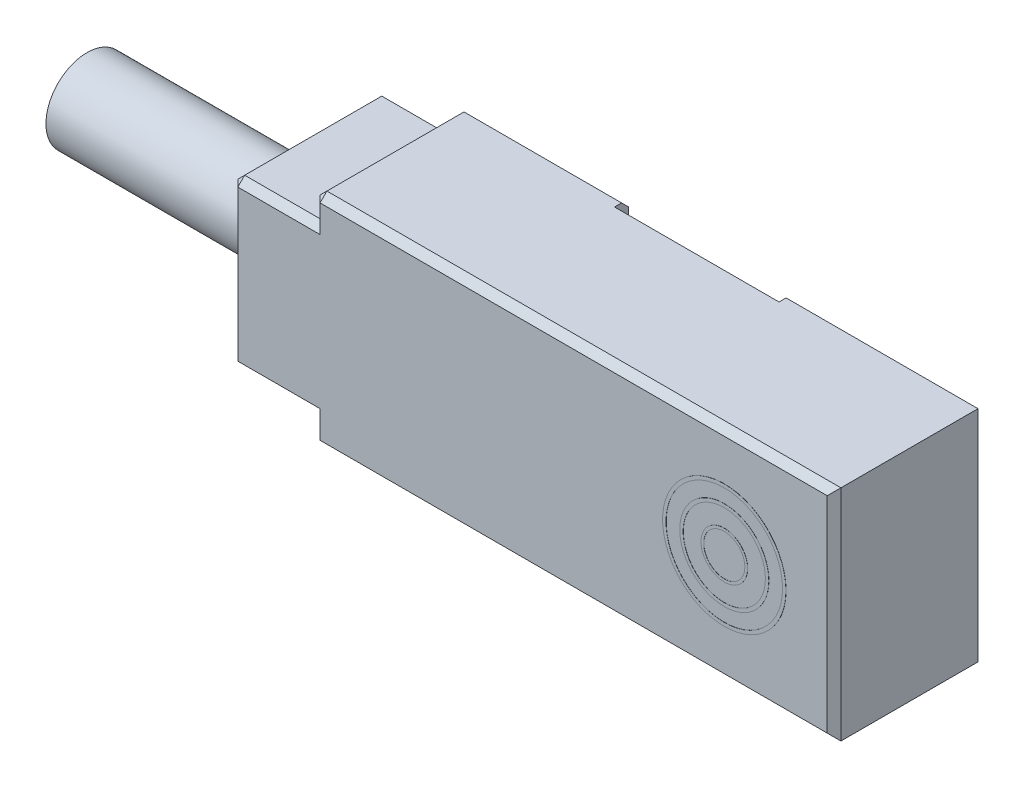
ISO-10303-21;
HEADER;
FILE_DESCRIPTION(('STEP AP214'),'2;1');
FILE_NAME('part.step','',(''),(''),'','','');
FILE_SCHEMA(('AUTOMOTIVE_DESIGN { 1 0 10303 214 1 1 1 1 }'));
ENDSEC;
DATA;
#1=APPLICATION_CONTEXT('core data for automotive mechanical design processes');
#2=APPLICATION_PROTOCOL_DEFINITION('international standard','automotive_design',2000,#1);
#3=PRODUCT_CONTEXT('',#1,'mechanical');
#4=PRODUCT('Part','Part','',(#3));
#5=PRODUCT_RELATED_PRODUCT_CATEGORY('part','',(#4));
#6=PRODUCT_DEFINITION_FORMATION('','',#4);
#7=PRODUCT_DEFINITION_CONTEXT('part definition',#1,'design');
#8=PRODUCT_DEFINITION('design','',#6,#7);
#9=PRODUCT_DEFINITION_SHAPE('','',#8);
#10=(LENGTH_UNIT() NAMED_UNIT(*) SI_UNIT(.MILLI.,.METRE.));
#11=(NAMED_UNIT(*) PLANE_ANGLE_UNIT() SI_UNIT($,.RADIAN.));
#12=(NAMED_UNIT(*) SI_UNIT($,.STERADIAN.) SOLID_ANGLE_UNIT());
#13=UNCERTAINTY_MEASURE_WITH_UNIT(LENGTH_MEASURE(1.E-05),#10,'distance_accuracy_value','');
#14=(GEOMETRIC_REPRESENTATION_CONTEXT(3) GLOBAL_UNCERTAINTY_ASSIGNED_CONTEXT((#13)) GLOBAL_UNIT_ASSIGNED_CONTEXT((#10,
#11,#12)) REPRESENTATION_CONTEXT('',''));
#15=CARTESIAN_POINT('',(0.,0.,0.));
#16=DIRECTION('',(0.,0.,1.));
#17=DIRECTION('',(1.,0.,0.));
#18=AXIS2_PLACEMENT_3D('',#15,#16,#17);
#19=CARTESIAN_POINT('',(-0.95,3.875,-2.625));
#20=DIRECTION('',(0.,0.707106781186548,-0.707106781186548));
#21=DIRECTION('',(0.,0.707106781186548,0.707106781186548));
#22=AXIS2_PLACEMENT_3D('',#19,#20,#21);
#23=PLANE('',#22);
#24=DIRECTION('',(0.,-0.707106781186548,-0.707106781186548));
#25=VECTOR('',#24,1.);
#26=CARTESIAN_POINT('',(7.,3.875,-2.625));
#27=LINE('',#26,#25);
#28=CARTESIAN_POINT('',(7.,4.,-2.5));
#29=VERTEX_POINT('',#28);
#30=CARTESIAN_POINT('',(7.,3.75,-2.75));
#31=VERTEX_POINT('',#30);
#32=EDGE_CURVE('E395',#29,#31,#27,.T.);
#33=ORIENTED_EDGE('',*,*,#32,.F.);
#34=DIRECTION('',(1.,0.,0.));
#35=VECTOR('',#34,1.);
#36=CARTESIAN_POINT('',(-0.95,4.,-2.5));
#37=LINE('',#36,#35);
#38=CARTESIAN_POINT('',(14.,4.,-2.5));
#39=VERTEX_POINT('',#38);
#40=EDGE_CURVE('E328',#29,#39,#37,.T.);
#41=ORIENTED_EDGE('',*,*,#40,.T.);
#42=DIRECTION('',(-0.577350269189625,-0.577350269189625,-0.577350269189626));
#43=VECTOR('',#42,1.);
#44=CARTESIAN_POINT('',(14.,4.,-2.5));
#45=LINE('',#44,#43);
#46=CARTESIAN_POINT('',(13.75,3.75,-2.75));
#47=VERTEX_POINT('',#46);
#48=EDGE_CURVE('E339',#39,#47,#45,.T.);
#49=ORIENTED_EDGE('',*,*,#48,.T.);
#50=DIRECTION('',(1.,0.,0.));
#51=VECTOR('',#50,1.);
#52=CARTESIAN_POINT('',(3.1,3.75,-2.75));
#53=LINE('',#52,#51);
#54=EDGE_CURVE('E675',#47,#31,#53,.F.);
#55=ORIENTED_EDGE('',*,*,#54,.T.);
#56=EDGE_LOOP('',(#33,#41,#49,#55));
#57=FACE_BOUND('',#56,.T.);
#58=ADVANCED_FACE('F37',(#57),#23,.T.);
#59=CARTESIAN_POINT('',(3.1,0.,-2.75));
#60=DIRECTION('',(0.,0.,1.));
#61=DIRECTION('',(1.,0.,0.));
#62=AXIS2_PLACEMENT_3D('',#59,#60,#61);
#63=PLANE('',#62);
#64=DIRECTION('',(0.,1.,0.));
#65=VECTOR('',#64,1.);
#66=CARTESIAN_POINT('',(7.,-4.,-2.75));
#67=LINE('',#66,#65);
#68=CARTESIAN_POINT('',(7.,-3.75,-2.75));
#69=VERTEX_POINT('',#68);
#70=EDGE_CURVE('E262',#69,#31,#67,.T.);
#71=ORIENTED_EDGE('',*,*,#70,.T.);
#72=ORIENTED_EDGE('',*,*,#54,.F.);
#73=DIRECTION('',(0.,1.,0.));
#74=VECTOR('',#73,1.);
#75=CARTESIAN_POINT('',(13.75,0.,-2.75));
#76=LINE('',#75,#74);
#77=CARTESIAN_POINT('',(13.75,-3.75,-2.75));
#78=VERTEX_POINT('',#77);
#79=EDGE_CURVE('E356',#78,#47,#76,.T.);
#80=ORIENTED_EDGE('',*,*,#79,.F.);
#81=DIRECTION('',(1.,0.,0.));
#82=VECTOR('',#81,1.);
#83=CARTESIAN_POINT('',(3.1,-3.75,-2.75));
#84=LINE('',#83,#82);
#85=EDGE_CURVE('E354',#69,#78,#84,.T.);
#86=ORIENTED_EDGE('',*,*,#85,.F.);
#87=EDGE_LOOP('',(#71,#72,#80,#86));
#88=FACE_BOUND('',#87,.T.);
#89=ADVANCED_FACE('F744',(#88),#63,.F.);
#90=CARTESIAN_POINT('',(3.1,0.,2.75));
#91=DIRECTION('',(0.,0.,1.));
#92=DIRECTION('',(1.,0.,0.));
#93=AXIS2_PLACEMENT_3D('',#90,#91,#92);
#94=PLANE('',#93);
#95=CARTESIAN_POINT('',(10.,0.,2.75));
#96=DIRECTION('',(0.,0.,1.));
#97=DIRECTION('',(1.,0.,0.));
#98=AXIS2_PLACEMENT_3D('',#95,#96,#97);
#99=CIRCLE('',#98,0.750000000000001);
#100=CARTESIAN_POINT('',(10.75,0.,2.75));
#101=VERTEX_POINT('',#100);
#102=EDGE_CURVE('E41',#101,#101,#99,.T.);
#103=ORIENTED_EDGE('',*,*,#102,.T.);
#104=EDGE_LOOP('',(#103));
#105=FACE_BOUND('',#104,.T.);
#106=ADVANCED_FACE('F39',(#105),#94,.T.);
#107=CARTESIAN_POINT('',(10.,0.,2.75));
#108=DIRECTION('',(0.,0.,1.));
#109=DIRECTION('',(1.,0.,0.));
#110=AXIS2_PLACEMENT_3D('',#107,#108,#109);
#111=CYLINDRICAL_SURFACE('',#110,0.750000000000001);
#112=CARTESIAN_POINT('',(10.,0.,2.755));
#113=DIRECTION('',(0.,0.,1.));
#114=DIRECTION('',(1.,0.,0.));
#115=AXIS2_PLACEMENT_3D('',#112,#113,#114);
#116=CIRCLE('',#115,0.750000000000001);
#117=CARTESIAN_POINT('',(10.75,0.,2.755));
#118=VERTEX_POINT('',#117);
#119=EDGE_CURVE('E1102',#118,#118,#116,.T.);
#120=ORIENTED_EDGE('',*,*,#119,.T.);
#121=EDGE_LOOP('',(#120));
#122=FACE_BOUND('',#121,.T.);
#123=ORIENTED_EDGE('',*,*,#102,.F.);
#124=EDGE_LOOP('',(#123));
#125=FACE_BOUND('',#124,.T.);
#126=ADVANCED_FACE('F1091',(#122,#125),#111,.F.);
#127=CARTESIAN_POINT('',(10.,0.,2.755));
#128=DIRECTION('',(0.,0.,-1.));
#129=DIRECTION('',(-1.,0.,0.));
#130=AXIS2_PLACEMENT_3D('',#127,#128,#129);
#131=PLANE('',#130);
#132=CARTESIAN_POINT('',(10.,0.,2.755));
#133=DIRECTION('',(0.,0.,1.));
#134=DIRECTION('',(1.,0.,0.));
#135=AXIS2_PLACEMENT_3D('',#132,#133,#134);
#136=CIRCLE('',#135,0.85);
#137=CARTESIAN_POINT('',(10.85,0.,2.755));
#138=VERTEX_POINT('',#137);
#139=EDGE_CURVE('E1105',#138,#138,#136,.F.);
#140=ORIENTED_EDGE('',*,*,#139,.F.);
#141=EDGE_LOOP('',(#140));
#142=FACE_BOUND('',#141,.T.);
#143=ORIENTED_EDGE('',*,*,#119,.F.);
#144=EDGE_LOOP('',(#143));
#145=FACE_BOUND('',#144,.T.);
#146=ADVANCED_FACE('F1088',(#142,#145),#131,.F.);
#147=CARTESIAN_POINT('',(10.,0.,2.75));
#148=DIRECTION('',(0.,0.,1.));
#149=DIRECTION('',(1.,0.,0.));
#150=AXIS2_PLACEMENT_3D('',#147,#148,#149);
#151=CYLINDRICAL_SURFACE('',#150,0.85);
#152=ORIENTED_EDGE('',*,*,#139,.T.);
#153=EDGE_LOOP('',(#152));
#154=FACE_BOUND('',#153,.T.);
#155=CARTESIAN_POINT('',(10.,0.,2.75));
#156=DIRECTION('',(0.,0.,1.));
#157=DIRECTION('',(1.,0.,0.));
#158=AXIS2_PLACEMENT_3D('',#155,#156,#157);
#159=CIRCLE('',#158,0.85);
#160=CARTESIAN_POINT('',(10.85,0.,2.75));
#161=VERTEX_POINT('',#160);
#162=EDGE_CURVE('E1107',#161,#161,#159,.F.);
#163=ORIENTED_EDGE('',*,*,#162,.F.);
#164=EDGE_LOOP('',(#163));
#165=FACE_BOUND('',#164,.T.);
#166=ADVANCED_FACE('F1057',(#154,#165),#151,.T.);
#167=CARTESIAN_POINT('',(3.1,0.,2.75));
#168=DIRECTION('',(0.,0.,1.));
#169=DIRECTION('',(1.,0.,0.));
#170=AXIS2_PLACEMENT_3D('',#167,#168,#169);
#171=PLANE('',#170);
#172=CARTESIAN_POINT('',(10.,0.,2.75));
#173=DIRECTION('',(0.,0.,1.));
#174=DIRECTION('',(1.,0.,0.));
#175=AXIS2_PLACEMENT_3D('',#172,#173,#174);
#176=CIRCLE('',#175,1.5);
#177=CARTESIAN_POINT('',(11.5,0.,2.75));
#178=VERTEX_POINT('',#177);
#179=EDGE_CURVE('E1117',#178,#178,#176,.T.);
#180=ORIENTED_EDGE('',*,*,#179,.T.);
#181=EDGE_LOOP('',(#180));
#182=FACE_BOUND('',#181,.T.);
#183=ORIENTED_EDGE('',*,*,#162,.T.);
#184=EDGE_LOOP('',(#183));
#185=FACE_BOUND('',#184,.T.);
#186=ADVANCED_FACE('F1051',(#182,#185),#171,.T.);
#187=CARTESIAN_POINT('',(10.,0.,2.75));
#188=DIRECTION('',(0.,0.,1.));
#189=DIRECTION('',(1.,0.,0.));
#190=AXIS2_PLACEMENT_3D('',#187,#188,#189);
#191=CYLINDRICAL_SURFACE('',#190,1.5);
#192=CARTESIAN_POINT('',(10.,0.,2.755));
#193=DIRECTION('',(0.,0.,1.));
#194=DIRECTION('',(1.,0.,0.));
#195=AXIS2_PLACEMENT_3D('',#192,#193,#194);
#196=CIRCLE('',#195,1.5);
#197=CARTESIAN_POINT('',(11.5,0.,2.755));
#198=VERTEX_POINT('',#197);
#199=EDGE_CURVE('E1120',#198,#198,#196,.T.);
#200=ORIENTED_EDGE('',*,*,#199,.T.);
#201=EDGE_LOOP('',(#200));
#202=FACE_BOUND('',#201,.T.);
#203=ORIENTED_EDGE('',*,*,#179,.F.);
#204=EDGE_LOOP('',(#203));
#205=FACE_BOUND('',#204,.T.);
#206=ADVANCED_FACE('F1056',(#202,#205),#191,.F.);
#207=CARTESIAN_POINT('',(10.,0.,2.755));
#208=DIRECTION('',(0.,0.,-1.));
#209=DIRECTION('',(-1.,0.,0.));
#210=AXIS2_PLACEMENT_3D('',#207,#208,#209);
#211=PLANE('',#210);
#212=CARTESIAN_POINT('',(10.,0.,2.755));
#213=DIRECTION('',(0.,0.,1.));
#214=DIRECTION('',(1.,0.,0.));
#215=AXIS2_PLACEMENT_3D('',#212,#213,#214);
#216=CIRCLE('',#215,1.625);
#217=CARTESIAN_POINT('',(11.625,0.,2.755));
#218=VERTEX_POINT('',#217);
#219=EDGE_CURVE('E1127',#218,#218,#216,.F.);
#220=ORIENTED_EDGE('',*,*,#219,.F.);
#221=EDGE_LOOP('',(#220));
#222=FACE_BOUND('',#221,.T.);
#223=ORIENTED_EDGE('',*,*,#199,.F.);
#224=EDGE_LOOP('',(#223));
#225=FACE_BOUND('',#224,.T.);
#226=ADVANCED_FACE('F1065',(#222,#225),#211,.F.);
#227=CARTESIAN_POINT('',(10.,0.,2.75));
#228=DIRECTION('',(0.,0.,1.));
#229=DIRECTION('',(1.,0.,0.));
#230=AXIS2_PLACEMENT_3D('',#227,#228,#229);
#231=CYLINDRICAL_SURFACE('',#230,1.625);
#232=ORIENTED_EDGE('',*,*,#219,.T.);
#233=EDGE_LOOP('',(#232));
#234=FACE_BOUND('',#233,.T.);
#235=CARTESIAN_POINT('',(10.,0.,2.75));
#236=DIRECTION('',(0.,0.,1.));
#237=DIRECTION('',(1.,0.,0.));
#238=AXIS2_PLACEMENT_3D('',#235,#236,#237);
#239=CIRCLE('',#238,1.625);
#240=CARTESIAN_POINT('',(11.625,0.,2.75));
#241=VERTEX_POINT('',#240);
#242=EDGE_CURVE('E1130',#241,#241,#239,.F.);
#243=ORIENTED_EDGE('',*,*,#242,.F.);
#244=EDGE_LOOP('',(#243));
#245=FACE_BOUND('',#244,.T.);
#246=ADVANCED_FACE('F1070',(#234,#245),#231,.T.);
#247=CARTESIAN_POINT('',(3.1,0.,2.75));
#248=DIRECTION('',(0.,0.,1.));
#249=DIRECTION('',(1.,0.,0.));
#250=AXIS2_PLACEMENT_3D('',#247,#248,#249);
#251=PLANE('',#250);
#252=ORIENTED_EDGE('',*,*,#242,.T.);
#253=EDGE_LOOP('',(#252));
#254=FACE_BOUND('',#253,.T.);
#255=CARTESIAN_POINT('',(10.,0.,2.75));
#256=DIRECTION('',(0.,0.,1.));
#257=DIRECTION('',(1.,0.,0.));
#258=AXIS2_PLACEMENT_3D('',#255,#256,#257);
#259=CIRCLE('',#258,2.125);
#260=CARTESIAN_POINT('',(12.125,0.,2.75));
#261=VERTEX_POINT('',#260);
#262=EDGE_CURVE('E1133',#261,#261,#259,.T.);
#263=ORIENTED_EDGE('',*,*,#262,.T.);
#264=EDGE_LOOP('',(#263));
#265=FACE_BOUND('',#264,.T.);
#266=ADVANCED_FACE('F1154',(#254,#265),#251,.T.);
#267=CARTESIAN_POINT('',(10.,0.,2.75));
#268=DIRECTION('',(0.,0.,1.));
#269=DIRECTION('',(1.,0.,0.));
#270=AXIS2_PLACEMENT_3D('',#267,#268,#269);
#271=CYLINDRICAL_SURFACE('',#270,2.125);
#272=CARTESIAN_POINT('',(10.,0.,2.755));
#273=DIRECTION('',(0.,0.,1.));
#274=DIRECTION('',(1.,0.,0.));
#275=AXIS2_PLACEMENT_3D('',#272,#273,#274);
#276=CIRCLE('',#275,2.125);
#277=CARTESIAN_POINT('',(12.125,0.,2.755));
#278=VERTEX_POINT('',#277);
#279=EDGE_CURVE('E1136',#278,#278,#276,.T.);
#280=ORIENTED_EDGE('',*,*,#279,.T.);
#281=EDGE_LOOP('',(#280));
#282=FACE_BOUND('',#281,.T.);
#283=ORIENTED_EDGE('',*,*,#262,.F.);
#284=EDGE_LOOP('',(#283));
#285=FACE_BOUND('',#284,.T.);
#286=ADVANCED_FACE('F1148',(#282,#285),#271,.F.);
#287=CARTESIAN_POINT('',(10.,0.,2.755));
#288=DIRECTION('',(0.,0.,-1.));
#289=DIRECTION('',(-1.,0.,0.));
#290=AXIS2_PLACEMENT_3D('',#287,#288,#289);
#291=PLANE('',#290);
#292=CARTESIAN_POINT('',(10.,0.,2.755));
#293=DIRECTION('',(0.,0.,1.));
#294=DIRECTION('',(1.,0.,0.));
#295=AXIS2_PLACEMENT_3D('',#292,#293,#294);
#296=CIRCLE('',#295,2.25);
#297=CARTESIAN_POINT('',(12.25,0.,2.755));
#298=VERTEX_POINT('',#297);
#299=EDGE_CURVE('E531',#298,#298,#296,.F.);
#300=ORIENTED_EDGE('',*,*,#299,.F.);
#301=EDGE_LOOP('',(#300));
#302=FACE_BOUND('',#301,.T.);
#303=ORIENTED_EDGE('',*,*,#279,.F.);
#304=EDGE_LOOP('',(#303));
#305=FACE_BOUND('',#304,.T.);
#306=ADVANCED_FACE('F1145',(#302,#305),#291,.F.);
#307=CARTESIAN_POINT('',(10.,0.,2.75));
#308=DIRECTION('',(0.,0.,1.));
#309=DIRECTION('',(1.,0.,0.));
#310=AXIS2_PLACEMENT_3D('',#307,#308,#309);
#311=CYLINDRICAL_SURFACE('',#310,2.25);
#312=ORIENTED_EDGE('',*,*,#299,.T.);
#313=EDGE_LOOP('',(#312));
#314=FACE_BOUND('',#313,.T.);
#315=CARTESIAN_POINT('',(10.,0.,2.75));
#316=DIRECTION('',(0.,0.,1.));
#317=DIRECTION('',(1.,0.,0.));
#318=AXIS2_PLACEMENT_3D('',#315,#316,#317);
#319=CIRCLE('',#318,2.25);
#320=CARTESIAN_POINT('',(12.25,0.,2.75));
#321=VERTEX_POINT('',#320);
#322=EDGE_CURVE('E530',#321,#321,#319,.F.);
#323=ORIENTED_EDGE('',*,*,#322,.F.);
#324=EDGE_LOOP('',(#323));
#325=FACE_BOUND('',#324,.T.);
#326=ADVANCED_FACE('F1142',(#314,#325),#311,.T.);
#327=CARTESIAN_POINT('',(-4.875,3.875,2.5));
#328=DIRECTION('',(-0.577350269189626,0.577350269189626,0.577350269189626));
#329=DIRECTION('',(0.707106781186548,0.,0.707106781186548));
#330=AXIS2_PLACEMENT_3D('',#327,#328,#329);
#331=PLANE('',#330);
#332=DIRECTION('',(0.707106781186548,0.,0.707106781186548));
#333=VECTOR('',#332,1.);
#334=CARTESIAN_POINT('',(-4.875,3.75,2.625));
#335=LINE('',#334,#333);
#336=CARTESIAN_POINT('',(-4.75,3.75,2.75));
#337=VERTEX_POINT('',#336);
#338=CARTESIAN_POINT('',(-5.,3.75,2.5));
#339=VERTEX_POINT('',#338);
#340=EDGE_CURVE('E242',#337,#339,#335,.F.);
#341=ORIENTED_EDGE('',*,*,#340,.F.);
#342=DIRECTION('',(0.,-0.707106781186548,0.707106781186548));
#343=VECTOR('',#342,1.);
#344=CARTESIAN_POINT('',(-4.75,3.875,2.625));
#345=LINE('',#344,#343);
#346=CARTESIAN_POINT('',(-4.75,4.,2.5));
#347=VERTEX_POINT('',#346);
#348=EDGE_CURVE('E510',#347,#337,#345,.T.);
#349=ORIENTED_EDGE('',*,*,#348,.F.);
#350=DIRECTION('',(-0.707106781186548,-0.707106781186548,0.));
#351=VECTOR('',#350,1.);
#352=CARTESIAN_POINT('',(-4.875,3.875,2.5));
#353=LINE('',#352,#351);
#354=EDGE_CURVE('E514',#339,#347,#353,.F.);
#355=ORIENTED_EDGE('',*,*,#354,.F.);
#356=EDGE_LOOP('',(#341,#349,#355));
#357=FACE_BOUND('',#356,.T.);
#358=ADVANCED_FACE('F711',(#357),#331,.T.);
#359=CARTESIAN_POINT('',(-4.875,1.5,2.625));
#360=DIRECTION('',(-0.707106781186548,0.,0.707106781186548));
#361=DIRECTION('',(0.707106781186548,0.,0.707106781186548));
#362=AXIS2_PLACEMENT_3D('',#359,#360,#361);
#363=PLANE('',#362);
#364=DIRECTION('',(0.,1.,0.));
#365=VECTOR('',#364,1.);
#366=CARTESIAN_POINT('',(-5.,3.,2.5));
#367=LINE('',#366,#365);
#368=CARTESIAN_POINT('',(-5.,3.,2.5));
#369=VERTEX_POINT('',#368);
#370=EDGE_CURVE('E545',#369,#339,#367,.T.);
#371=ORIENTED_EDGE('',*,*,#370,.F.);
#372=DIRECTION('',(-0.577350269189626,0.577350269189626,-0.577350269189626));
#373=VECTOR('',#372,1.);
#374=CARTESIAN_POINT('',(-4.75,2.75,2.75));
#375=LINE('',#374,#373);
#376=CARTESIAN_POINT('',(-4.75,2.75,2.75));
#377=VERTEX_POINT('',#376);
#378=EDGE_CURVE('E553',#377,#369,#375,.T.);
#379=ORIENTED_EDGE('',*,*,#378,.F.);
#380=DIRECTION('',(0.,1.,0.));
#381=VECTOR('',#380,1.);
#382=CARTESIAN_POINT('',(-4.75,0.,2.75));
#383=LINE('',#382,#381);
#384=EDGE_CURVE('E526',#337,#377,#383,.F.);
#385=ORIENTED_EDGE('',*,*,#384,.F.);
#386=ORIENTED_EDGE('',*,*,#340,.T.);
#387=EDGE_LOOP('',(#371,#379,#385,#386));
#388=FACE_BOUND('',#387,.T.);
#389=ADVANCED_FACE('F716',(#388),#363,.T.);
#390=CARTESIAN_POINT('',(-7.875,2.875,2.5));
#391=DIRECTION('',(-0.577350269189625,0.577350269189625,0.577350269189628));
#392=DIRECTION('',(0.707106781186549,0.,0.707106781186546));
#393=AXIS2_PLACEMENT_3D('',#390,#391,#392);
#394=PLANE('',#393);
#395=DIRECTION('',(0.707106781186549,0.,0.707106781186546));
#396=VECTOR('',#395,1.);
#397=CARTESIAN_POINT('',(-7.875,2.75,2.625));
#398=LINE('',#397,#396);
#399=CARTESIAN_POINT('',(-7.75,2.75,2.75));
#400=VERTEX_POINT('',#399);
#401=CARTESIAN_POINT('',(-8.,2.75,2.5));
#402=VERTEX_POINT('',#401);
#403=EDGE_CURVE('E475',#400,#402,#398,.F.);
#404=ORIENTED_EDGE('',*,*,#403,.F.);
#405=DIRECTION('',(0.,-0.707106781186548,0.707106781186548));
#406=VECTOR('',#405,1.);
#407=CARTESIAN_POINT('',(-7.75,2.875,2.625));
#408=LINE('',#407,#406);
#409=CARTESIAN_POINT('',(-7.75,3.,2.5));
#410=VERTEX_POINT('',#409);
#411=EDGE_CURVE('E477',#410,#400,#408,.T.);
#412=ORIENTED_EDGE('',*,*,#411,.F.);
#413=DIRECTION('',(-0.707106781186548,-0.707106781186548,0.));
#414=VECTOR('',#413,1.);
#415=CARTESIAN_POINT('',(-7.875,2.875,2.5));
#416=LINE('',#415,#414);
#417=EDGE_CURVE('E473',#402,#410,#416,.F.);
#418=ORIENTED_EDGE('',*,*,#417,.F.);
#419=EDGE_LOOP('',(#404,#412,#418));
#420=FACE_BOUND('',#419,.T.);
#421=ADVANCED_FACE('F474',(#420),#394,.T.);
#422=CARTESIAN_POINT('',(-16.,0.,0.));
#423=DIRECTION('',(-1.,0.,0.));
#424=DIRECTION('',(0.,0.,1.));
#425=AXIS2_PLACEMENT_3D('',#422,#423,#424);
#426=PLANE('',#425);
#427=CARTESIAN_POINT('',(-16.,0.,0.));
#428=DIRECTION('',(1.,0.,0.));
#429=DIRECTION('',(0.,0.,-1.));
#430=AXIS2_PLACEMENT_3D('',#427,#428,#429);
#431=CIRCLE('',#430,1.5);
#432=CARTESIAN_POINT('',(-16.,0.,-1.5));
#433=VERTEX_POINT('',#432);
#434=EDGE_CURVE('E481',#433,#433,#431,.T.);
#435=ORIENTED_EDGE('',*,*,#434,.F.);
#436=EDGE_LOOP('',(#435));
#437=FACE_BOUND('',#436,.T.);
#438=ADVANCED_FACE('F1173',(#437),#426,.T.);
#439=CARTESIAN_POINT('',(-4.875,-2.,2.625));
#440=DIRECTION('',(-0.707106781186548,0.,0.707106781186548));
#441=DIRECTION('',(0.707106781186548,0.,0.707106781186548));
#442=AXIS2_PLACEMENT_3D('',#439,#440,#441);
#443=PLANE('',#442);
#444=DIRECTION('',(0.,1.,0.));
#445=VECTOR('',#444,1.);
#446=CARTESIAN_POINT('',(-4.75,0.,2.75));
#447=LINE('',#446,#445);
#448=CARTESIAN_POINT('',(-4.75,-2.75,2.75));
#449=VERTEX_POINT('',#448);
#450=CARTESIAN_POINT('',(-4.75,-3.75,2.75));
#451=VERTEX_POINT('',#450);
#452=EDGE_CURVE('E528',#449,#451,#447,.F.);
#453=ORIENTED_EDGE('',*,*,#452,.F.);
#454=DIRECTION('',(0.577350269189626,0.577350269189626,0.577350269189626));
#455=VECTOR('',#454,1.);
#456=CARTESIAN_POINT('',(-5.,-3.,2.5));
#457=LINE('',#456,#455);
#458=CARTESIAN_POINT('',(-5.,-3.,2.5));
#459=VERTEX_POINT('',#458);
#460=EDGE_CURVE('E623',#459,#449,#457,.T.);
#461=ORIENTED_EDGE('',*,*,#460,.F.);
#462=DIRECTION('',(0.,1.,0.));
#463=VECTOR('',#462,1.);
#464=CARTESIAN_POINT('',(-5.,-4.,2.5));
#465=LINE('',#464,#463);
#466=CARTESIAN_POINT('',(-5.,-3.75,2.5));
#467=VERTEX_POINT('',#466);
#468=EDGE_CURVE('E630',#467,#459,#465,.T.);
#469=ORIENTED_EDGE('',*,*,#468,.F.);
#470=DIRECTION('',(0.707106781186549,0.,0.707106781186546));
#471=VECTOR('',#470,1.);
#472=CARTESIAN_POINT('',(-4.9375,-3.75,2.5625));
#473=LINE('',#472,#471);
#474=EDGE_CURVE('E524',#451,#467,#473,.F.);
#475=ORIENTED_EDGE('',*,*,#474,.F.);
#476=EDGE_LOOP('',(#453,#461,#469,#475));
#477=FACE_BOUND('',#476,.T.);
#478=ADVANCED_FACE('F728',(#477),#443,.T.);
#479=CARTESIAN_POINT('',(-7.875,-2.875,2.5));
#480=DIRECTION('',(-0.577350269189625,-0.577350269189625,0.577350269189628));
#481=DIRECTION('',(0.707106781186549,0.,0.707106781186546));
#482=AXIS2_PLACEMENT_3D('',#479,#480,#481);
#483=PLANE('',#482);
#484=DIRECTION('',(0.707106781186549,0.,0.707106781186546));
#485=VECTOR('',#484,1.);
#486=CARTESIAN_POINT('',(-7.875,-2.75,2.625));
#487=LINE('',#486,#485);
#488=CARTESIAN_POINT('',(-8.,-2.75,2.5));
#489=VERTEX_POINT('',#488);
#490=CARTESIAN_POINT('',(-7.75,-2.75,2.75));
#491=VERTEX_POINT('',#490);
#492=EDGE_CURVE('E496',#489,#491,#487,.T.);
#493=ORIENTED_EDGE('',*,*,#492,.F.);
#494=DIRECTION('',(0.707106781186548,-0.707106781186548,0.));
#495=VECTOR('',#494,1.);
#496=CARTESIAN_POINT('',(-7.875,-2.875,2.5));
#497=LINE('',#496,#495);
#498=CARTESIAN_POINT('',(-7.75,-3.,2.5));
#499=VERTEX_POINT('',#498);
#500=EDGE_CURVE('E619',#499,#489,#497,.F.);
#501=ORIENTED_EDGE('',*,*,#500,.F.);
#502=DIRECTION('',(0.,-0.707106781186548,-0.707106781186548));
#503=VECTOR('',#502,1.);
#504=CARTESIAN_POINT('',(-7.75,-2.875,2.625));
#505=LINE('',#504,#503);
#506=EDGE_CURVE('E626',#491,#499,#505,.T.);
#507=ORIENTED_EDGE('',*,*,#506,.F.);
#508=EDGE_LOOP('',(#493,#501,#507));
#509=FACE_BOUND('',#508,.T.);
#510=ADVANCED_FACE('F741',(#509),#483,.T.);
#511=CARTESIAN_POINT('',(3.1,0.,2.75));
#512=DIRECTION('',(0.,0.,1.));
#513=DIRECTION('',(1.,0.,0.));
#514=AXIS2_PLACEMENT_3D('',#511,#512,#513);
#515=PLANE('',#514);
#516=ORIENTED_EDGE('',*,*,#384,.T.);
#517=DIRECTION('',(1.,0.,0.));
#518=VECTOR('',#517,1.);
#519=CARTESIAN_POINT('',(-2.45,2.75,2.75));
#520=LINE('',#519,#518);
#521=EDGE_CURVE('E554',#400,#377,#520,.T.);
#522=ORIENTED_EDGE('',*,*,#521,.F.);
#523=DIRECTION('',(0.,1.,0.));
#524=VECTOR('',#523,1.);
#525=CARTESIAN_POINT('',(-7.75,-1.5,2.75));
#526=LINE('',#525,#524);
#527=EDGE_CURVE('E490',#491,#400,#526,.T.);
#528=ORIENTED_EDGE('',*,*,#527,.F.);
#529=DIRECTION('',(1.,0.,0.));
#530=VECTOR('',#529,1.);
#531=CARTESIAN_POINT('',(-0.95,-2.75,2.75));
#532=LINE('',#531,#530);
#533=EDGE_CURVE('E628',#449,#491,#532,.F.);
#534=ORIENTED_EDGE('',*,*,#533,.F.);
#535=ORIENTED_EDGE('',*,*,#452,.T.);
#536=DIRECTION('',(1.,0.,0.));
#537=VECTOR('',#536,1.);
#538=CARTESIAN_POINT('',(8.55,-3.75,2.75));
#539=LINE('',#538,#537);
#540=CARTESIAN_POINT('',(13.75,-3.75,2.75));
#541=VERTEX_POINT('',#540);
#542=EDGE_CURVE('E605',#541,#451,#539,.F.);
#543=ORIENTED_EDGE('',*,*,#542,.F.);
#544=DIRECTION('',(0.,1.,0.));
#545=VECTOR('',#544,1.);
#546=CARTESIAN_POINT('',(13.75,2.,2.75));
#547=LINE('',#546,#545);
#548=CARTESIAN_POINT('',(13.75,3.75,2.75));
#549=VERTEX_POINT('',#548);
#550=EDGE_CURVE('E518',#549,#541,#547,.F.);
#551=ORIENTED_EDGE('',*,*,#550,.F.);
#552=DIRECTION('',(1.,0.,0.));
#553=VECTOR('',#552,1.);
#554=CARTESIAN_POINT('',(-0.95,3.75,2.75));
#555=LINE('',#554,#553);
#556=EDGE_CURVE('E505',#337,#549,#555,.T.);
#557=ORIENTED_EDGE('',*,*,#556,.F.);
#558=EDGE_LOOP('',(#516,#522,#528,#534,#535,#543,#551,#557));
#559=FACE_BOUND('',#558,.T.);
#560=ORIENTED_EDGE('',*,*,#322,.T.);
#561=EDGE_LOOP('',(#560));
#562=FACE_BOUND('',#561,.T.);
#563=ADVANCED_FACE('F719',(#559,#562),#515,.T.);
#564=CARTESIAN_POINT('',(-4.875,-3.875,2.5));
#565=DIRECTION('',(-0.577350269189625,-0.577350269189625,0.577350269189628));
#566=DIRECTION('',(0.707106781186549,0.,0.707106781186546));
#567=AXIS2_PLACEMENT_3D('',#564,#565,#566);
#568=PLANE('',#567);
#569=ORIENTED_EDGE('',*,*,#474,.T.);
#570=DIRECTION('',(0.707106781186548,-0.707106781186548,0.));
#571=VECTOR('',#570,1.);
#572=CARTESIAN_POINT('',(-4.875,-3.875,2.5));
#573=LINE('',#572,#571);
#574=CARTESIAN_POINT('',(-4.75,-4.,2.5));
#575=VERTEX_POINT('',#574);
#576=EDGE_CURVE('E595',#575,#467,#573,.F.);
#577=ORIENTED_EDGE('',*,*,#576,.F.);
#578=DIRECTION('',(0.,-0.707106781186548,-0.707106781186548));
#579=VECTOR('',#578,1.);
#580=CARTESIAN_POINT('',(-4.75000000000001,-3.875,2.625));
#581=LINE('',#580,#579);
#582=EDGE_CURVE('E603',#451,#575,#581,.T.);
#583=ORIENTED_EDGE('',*,*,#582,.F.);
#584=EDGE_LOOP('',(#569,#577,#583));
#585=FACE_BOUND('',#584,.T.);
#586=ADVANCED_FACE('F731',(#585),#568,.T.);
#587=CARTESIAN_POINT('',(-1.875,-2.5,-1.25));
#588=DIRECTION('',(0.,1.,0.));
#589=DIRECTION('',(-1.,0.,0.));
#590=AXIS2_PLACEMENT_3D('',#587,#588,#589);
#591=PLANE('',#590);
#592=DIRECTION('',(-1.,0.,0.));
#593=VECTOR('',#592,1.);
#594=CARTESIAN_POINT('',(-1.875,-2.5,0.25));
#595=LINE('',#594,#593);
#596=CARTESIAN_POINT('',(-2.625,-2.5,0.25));
#597=VERTEX_POINT('',#596);
#598=CARTESIAN_POINT('',(-1.125,-2.5,0.25));
#599=VERTEX_POINT('',#598);
#600=EDGE_CURVE('E520',#597,#599,#595,.F.);
#601=ORIENTED_EDGE('',*,*,#600,.F.);
#602=DIRECTION('',(0.,0.,1.));
#603=VECTOR('',#602,1.);
#604=CARTESIAN_POINT('',(-2.625,-2.5,-1.25));
#605=LINE('',#604,#603);
#606=CARTESIAN_POINT('',(-2.625,-2.5,-2.75));
#607=VERTEX_POINT('',#606);
#608=EDGE_CURVE('E589',#597,#607,#605,.F.);
#609=ORIENTED_EDGE('',*,*,#608,.T.);
#610=DIRECTION('',(-1.,0.,0.));
#611=VECTOR('',#610,1.);
#612=CARTESIAN_POINT('',(-1.875,-2.5,-2.75));
#613=LINE('',#612,#611);
#614=CARTESIAN_POINT('',(-1.125,-2.5,-2.75));
#615=VERTEX_POINT('',#614);
#616=EDGE_CURVE('E521',#615,#607,#613,.T.);
#617=ORIENTED_EDGE('',*,*,#616,.F.);
#618=DIRECTION('',(0.,0.,-1.));
#619=VECTOR('',#618,1.);
#620=CARTESIAN_POINT('',(-1.125,-2.5,-1.25));
#621=LINE('',#620,#619);
#622=EDGE_CURVE('E611',#615,#599,#621,.F.);
#623=ORIENTED_EDGE('',*,*,#622,.T.);
#624=EDGE_LOOP('',(#601,#609,#617,#623));
#625=FACE_BOUND('',#624,.T.);
#626=ADVANCED_FACE('F733',(#625),#591,.F.);
#627=CARTESIAN_POINT('',(13.875,2.,2.625));
#628=DIRECTION('',(0.707106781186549,0.,0.707106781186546));
#629=DIRECTION('',(0.707106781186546,0.,-0.707106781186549));
#630=AXIS2_PLACEMENT_3D('',#627,#628,#629);
#631=PLANE('',#630);
#632=DIRECTION('',(0.,1.,0.));
#633=VECTOR('',#632,1.);
#634=CARTESIAN_POINT('',(14.,4.,2.5));
#635=LINE('',#634,#633);
#636=CARTESIAN_POINT('',(14.,4.,2.5));
#637=VERTEX_POINT('',#636);
#638=CARTESIAN_POINT('',(14.,-4.,2.5));
#639=VERTEX_POINT('',#638);
#640=EDGE_CURVE('E566',#637,#639,#635,.F.);
#641=ORIENTED_EDGE('',*,*,#640,.F.);
#642=DIRECTION('',(0.577350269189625,0.577350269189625,-0.577350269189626));
#643=VECTOR('',#642,1.);
#644=CARTESIAN_POINT('',(13.75,3.75,2.75));
#645=LINE('',#644,#643);
#646=EDGE_CURVE('E509',#549,#637,#645,.T.);
#647=ORIENTED_EDGE('',*,*,#646,.F.);
#648=ORIENTED_EDGE('',*,*,#550,.T.);
#649=DIRECTION('',(-0.577350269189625,0.577350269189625,0.577350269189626));
#650=VECTOR('',#649,1.);
#651=CARTESIAN_POINT('',(14.,-4.,2.5));
#652=LINE('',#651,#650);
#653=EDGE_CURVE('E567',#639,#541,#652,.T.);
#654=ORIENTED_EDGE('',*,*,#653,.F.);
#655=EDGE_LOOP('',(#641,#647,#648,#654));
#656=FACE_BOUND('',#655,.T.);
#657=ADVANCED_FACE('F564',(#656),#631,.T.);
#658=CARTESIAN_POINT('',(-4.875,3.875,0.));
#659=DIRECTION('',(-0.707106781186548,0.707106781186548,0.));
#660=DIRECTION('',(-0.707106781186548,-0.707106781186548,0.));
#661=AXIS2_PLACEMENT_3D('',#658,#659,#660);
#662=PLANE('',#661);
#663=DIRECTION('',(0.,0.,1.));
#664=VECTOR('',#663,1.);
#665=CARTESIAN_POINT('',(-4.75,4.,0.));
#666=LINE('',#665,#664);
#667=CARTESIAN_POINT('',(-4.75,4.,-2.5));
#668=VERTEX_POINT('',#667);
#669=EDGE_CURVE('E409',#668,#347,#666,.T.);
#670=ORIENTED_EDGE('',*,*,#669,.F.);
#671=DIRECTION('',(-0.577350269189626,-0.577350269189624,-0.577350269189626));
#672=VECTOR('',#671,1.);
#673=CARTESIAN_POINT('',(-4.75,4.,-2.5));
#674=LINE('',#673,#672);
#675=CARTESIAN_POINT('',(-4.875,3.875,-2.625));
#676=VERTEX_POINT('',#675);
#677=EDGE_CURVE('E247',#668,#676,#674,.T.);
#678=ORIENTED_EDGE('',*,*,#677,.T.);
#679=DIRECTION('',(-0.577350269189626,-0.577350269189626,0.577350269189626));
#680=VECTOR('',#679,1.);
#681=CARTESIAN_POINT('',(-4.875,3.875,-2.625));
#682=LINE('',#681,#680);
#683=CARTESIAN_POINT('',(-5.,3.75,-2.5));
#684=VERTEX_POINT('',#683);
#685=EDGE_CURVE('E516',#676,#684,#682,.T.);
#686=ORIENTED_EDGE('',*,*,#685,.T.);
#687=DIRECTION('',(0.,0.,1.));
#688=VECTOR('',#687,1.);
#689=CARTESIAN_POINT('',(-5.,3.75,0.));
#690=LINE('',#689,#688);
#691=EDGE_CURVE('E550',#339,#684,#690,.F.);
#692=ORIENTED_EDGE('',*,*,#691,.F.);
#693=ORIENTED_EDGE('',*,*,#354,.T.);
#694=EDGE_LOOP('',(#670,#678,#686,#692,#693));
#695=FACE_BOUND('',#694,.T.);
#696=ADVANCED_FACE('F709',(#695),#662,.T.);
#697=CARTESIAN_POINT('',(-0.95,3.875,2.625));
#698=DIRECTION('',(0.,0.707106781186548,0.707106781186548));
#699=DIRECTION('',(0.,-0.707106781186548,0.707106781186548));
#700=AXIS2_PLACEMENT_3D('',#697,#698,#699);
#701=PLANE('',#700);
#702=ORIENTED_EDGE('',*,*,#556,.T.);
#703=ORIENTED_EDGE('',*,*,#646,.T.);
#704=DIRECTION('',(1.,0.,0.));
#705=VECTOR('',#704,1.);
#706=CARTESIAN_POINT('',(-5.,4.,2.5));
#707=LINE('',#706,#705);
#708=EDGE_CURVE('E402',#347,#637,#707,.T.);
#709=ORIENTED_EDGE('',*,*,#708,.F.);
#710=ORIENTED_EDGE('',*,*,#348,.T.);
#711=EDGE_LOOP('',(#702,#703,#709,#710));
#712=FACE_BOUND('',#711,.T.);
#713=ADVANCED_FACE('F560',(#712),#701,.T.);
#714=CARTESIAN_POINT('',(-2.45,2.875,2.625));
#715=DIRECTION('',(0.,0.707106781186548,0.707106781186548));
#716=DIRECTION('',(0.,-0.707106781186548,0.707106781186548));
#717=AXIS2_PLACEMENT_3D('',#714,#715,#716);
#718=PLANE('',#717);
#719=ORIENTED_EDGE('',*,*,#521,.T.);
#720=ORIENTED_EDGE('',*,*,#378,.T.);
#721=DIRECTION('',(1.,0.,0.));
#722=VECTOR('',#721,1.);
#723=CARTESIAN_POINT('',(-8.,3.,2.5));
#724=LINE('',#723,#722);
#725=EDGE_CURVE('E407',#410,#369,#724,.T.);
#726=ORIENTED_EDGE('',*,*,#725,.F.);
#727=ORIENTED_EDGE('',*,*,#411,.T.);
#728=EDGE_LOOP('',(#719,#720,#726,#727));
#729=FACE_BOUND('',#728,.T.);
#730=ADVANCED_FACE('F831',(#729),#718,.T.);
#731=CARTESIAN_POINT('',(-5.,3.,0.));
#732=DIRECTION('',(-1.,0.,0.));
#733=DIRECTION('',(0.,0.,1.));
#734=AXIS2_PLACEMENT_3D('',#731,#732,#733);
#735=PLANE('',#734);
#736=ORIENTED_EDGE('',*,*,#370,.T.);
#737=ORIENTED_EDGE('',*,*,#691,.T.);
#738=DIRECTION('',(0.,1.,0.));
#739=VECTOR('',#738,1.);
#740=CARTESIAN_POINT('',(-5.,3.,-2.5));
#741=LINE('',#740,#739);
#742=CARTESIAN_POINT('',(-5.,3.,-2.5));
#743=VERTEX_POINT('',#742);
#744=EDGE_CURVE('E551',#684,#743,#741,.F.);
#745=ORIENTED_EDGE('',*,*,#744,.T.);
#746=DIRECTION('',(0.,0.,1.));
#747=VECTOR('',#746,1.);
#748=CARTESIAN_POINT('',(-5.,3.,0.));
#749=LINE('',#748,#747);
#750=EDGE_CURVE('E425',#369,#743,#749,.F.);
#751=ORIENTED_EDGE('',*,*,#750,.F.);
#752=EDGE_LOOP('',(#736,#737,#745,#751));
#753=FACE_BOUND('',#752,.T.);
#754=ADVANCED_FACE('F828',(#753),#735,.T.);
#755=CARTESIAN_POINT('',(-7.875,-1.5,2.625));
#756=DIRECTION('',(-0.707106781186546,0.,0.707106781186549));
#757=DIRECTION('',(0.707106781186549,0.,0.707106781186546));
#758=AXIS2_PLACEMENT_3D('',#755,#756,#757);
#759=PLANE('',#758);
#760=ORIENTED_EDGE('',*,*,#492,.T.);
#761=ORIENTED_EDGE('',*,*,#527,.T.);
#762=ORIENTED_EDGE('',*,*,#403,.T.);
#763=DIRECTION('',(0.,1.,0.));
#764=VECTOR('',#763,1.);
#765=CARTESIAN_POINT('',(-8.,-3.,2.5));
#766=LINE('',#765,#764);
#767=EDGE_CURVE('E431',#489,#402,#766,.T.);
#768=ORIENTED_EDGE('',*,*,#767,.F.);
#769=EDGE_LOOP('',(#760,#761,#762,#768));
#770=FACE_BOUND('',#769,.T.);
#771=ADVANCED_FACE('F825',(#770),#759,.T.);
#772=CARTESIAN_POINT('',(-7.875,2.875,0.));
#773=DIRECTION('',(-0.707106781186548,0.707106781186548,0.));
#774=DIRECTION('',(-0.707106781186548,-0.707106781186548,0.));
#775=AXIS2_PLACEMENT_3D('',#772,#773,#774);
#776=PLANE('',#775);
#777=ORIENTED_EDGE('',*,*,#417,.T.);
#778=DIRECTION('',(0.,0.,1.));
#779=VECTOR('',#778,1.);
#780=CARTESIAN_POINT('',(-7.75,3.,0.));
#781=LINE('',#780,#779);
#782=CARTESIAN_POINT('',(-7.75,3.,-2.5));
#783=VERTEX_POINT('',#782);
#784=EDGE_CURVE('E404',#783,#410,#781,.T.);
#785=ORIENTED_EDGE('',*,*,#784,.F.);
#786=DIRECTION('',(-0.577350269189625,-0.577350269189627,-0.577350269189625));
#787=VECTOR('',#786,1.);
#788=CARTESIAN_POINT('',(-7.75,3.,-2.5));
#789=LINE('',#788,#787);
#790=CARTESIAN_POINT('',(-7.875,2.875,-2.625));
#791=VERTEX_POINT('',#790);
#792=EDGE_CURVE('E486',#783,#791,#789,.T.);
#793=ORIENTED_EDGE('',*,*,#792,.T.);
#794=DIRECTION('',(-0.577350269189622,-0.577350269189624,0.57735026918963));
#795=VECTOR('',#794,1.);
#796=CARTESIAN_POINT('',(-7.875,2.875,-2.625));
#797=LINE('',#796,#795);
#798=CARTESIAN_POINT('',(-8.,2.75,-2.5));
#799=VERTEX_POINT('',#798);
#800=EDGE_CURVE('E482',#791,#799,#797,.T.);
#801=ORIENTED_EDGE('',*,*,#800,.T.);
#802=DIRECTION('',(0.,0.,1.));
#803=VECTOR('',#802,1.);
#804=CARTESIAN_POINT('',(-8.,2.75,0.));
#805=LINE('',#804,#803);
#806=EDGE_CURVE('E457',#402,#799,#805,.F.);
#807=ORIENTED_EDGE('',*,*,#806,.F.);
#808=EDGE_LOOP('',(#777,#785,#793,#801,#807));
#809=FACE_BOUND('',#808,.T.);
#810=ADVANCED_FACE('F484',(#809),#776,.T.);
#811=CARTESIAN_POINT('',(-16.,0.,0.));
#812=DIRECTION('',(1.,0.,0.));
#813=DIRECTION('',(0.,0.,-1.));
#814=AXIS2_PLACEMENT_3D('',#811,#812,#813);
#815=CYLINDRICAL_SURFACE('',#814,1.5);
#816=CARTESIAN_POINT('',(-8.,0.,0.));
#817=DIRECTION('',(1.,0.,0.));
#818=DIRECTION('',(0.,0.,-1.));
#819=AXIS2_PLACEMENT_3D('',#816,#817,#818);
#820=CIRCLE('',#819,1.5);
#821=CARTESIAN_POINT('',(-8.,0.,-1.5));
#822=VERTEX_POINT('',#821);
#823=EDGE_CURVE('E456',#822,#822,#820,.T.);
#824=ORIENTED_EDGE('',*,*,#823,.F.);
#825=EDGE_LOOP('',(#824));
#826=FACE_BOUND('',#825,.T.);
#827=ORIENTED_EDGE('',*,*,#434,.T.);
#828=EDGE_LOOP('',(#827));
#829=FACE_BOUND('',#828,.T.);
#830=ADVANCED_FACE('F819',(#826,#829),#815,.T.);
#831=CARTESIAN_POINT('',(-5.,-4.,0.));
#832=DIRECTION('',(-1.,0.,0.));
#833=DIRECTION('',(0.,0.,1.));
#834=AXIS2_PLACEMENT_3D('',#831,#832,#833);
#835=PLANE('',#834);
#836=ORIENTED_EDGE('',*,*,#468,.T.);
#837=DIRECTION('',(0.,0.,-1.));
#838=VECTOR('',#837,1.);
#839=CARTESIAN_POINT('',(-5.,-3.,0.));
#840=LINE('',#839,#838);
#841=CARTESIAN_POINT('',(-5.,-3.,-2.5));
#842=VERTEX_POINT('',#841);
#843=EDGE_CURVE('E454',#842,#459,#840,.F.);
#844=ORIENTED_EDGE('',*,*,#843,.F.);
#845=DIRECTION('',(0.,1.,0.));
#846=VECTOR('',#845,1.);
#847=CARTESIAN_POINT('',(-5.,-4.,-2.5));
#848=LINE('',#847,#846);
#849=CARTESIAN_POINT('',(-5.,-3.75,-2.5));
#850=VERTEX_POINT('',#849);
#851=EDGE_CURVE('E537',#842,#850,#848,.F.);
#852=ORIENTED_EDGE('',*,*,#851,.T.);
#853=DIRECTION('',(0.,0.,1.));
#854=VECTOR('',#853,1.);
#855=CARTESIAN_POINT('',(-5.,-3.75,0.));
#856=LINE('',#855,#854);
#857=EDGE_CURVE('E592',#467,#850,#856,.F.);
#858=ORIENTED_EDGE('',*,*,#857,.F.);
#859=EDGE_LOOP('',(#836,#844,#852,#858));
#860=FACE_BOUND('',#859,.T.);
#861=ADVANCED_FACE('F635',(#860),#835,.T.);
#862=CARTESIAN_POINT('',(-0.95,-2.875,2.625));
#863=DIRECTION('',(0.,-0.707106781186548,0.707106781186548));
#864=DIRECTION('',(0.,-0.707106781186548,-0.707106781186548));
#865=AXIS2_PLACEMENT_3D('',#862,#863,#864);
#866=PLANE('',#865);
#867=DIRECTION('',(1.,0.,0.));
#868=VECTOR('',#867,1.);
#869=CARTESIAN_POINT('',(-5.,-3.,2.5));
#870=LINE('',#869,#868);
#871=EDGE_CURVE('E451',#459,#499,#870,.F.);
#872=ORIENTED_EDGE('',*,*,#871,.F.);
#873=ORIENTED_EDGE('',*,*,#460,.T.);
#874=ORIENTED_EDGE('',*,*,#533,.T.);
#875=ORIENTED_EDGE('',*,*,#506,.T.);
#876=EDGE_LOOP('',(#872,#873,#874,#875));
#877=FACE_BOUND('',#876,.T.);
#878=ADVANCED_FACE('F812',(#877),#866,.T.);
#879=CARTESIAN_POINT('',(-7.875,-2.875,0.));
#880=DIRECTION('',(-0.707106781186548,-0.707106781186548,0.));
#881=DIRECTION('',(0.707106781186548,-0.707106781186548,0.));
#882=AXIS2_PLACEMENT_3D('',#879,#880,#881);
#883=PLANE('',#882);
#884=DIRECTION('',(0.,0.,1.));
#885=VECTOR('',#884,1.);
#886=CARTESIAN_POINT('',(-8.,-2.75,0.));
#887=LINE('',#886,#885);
#888=CARTESIAN_POINT('',(-8.,-2.75,-2.5));
#889=VERTEX_POINT('',#888);
#890=EDGE_CURVE('E428',#889,#489,#887,.T.);
#891=ORIENTED_EDGE('',*,*,#890,.F.);
#892=DIRECTION('',(0.577350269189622,-0.577350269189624,-0.57735026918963));
#893=VECTOR('',#892,1.);
#894=CARTESIAN_POINT('',(-8.,-2.75,-2.5));
#895=LINE('',#894,#893);
#896=CARTESIAN_POINT('',(-7.875,-2.875,-2.625));
#897=VERTEX_POINT('',#896);
#898=EDGE_CURVE('E617',#889,#897,#895,.T.);
#899=ORIENTED_EDGE('',*,*,#898,.T.);
#900=DIRECTION('',(0.577350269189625,-0.577350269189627,0.577350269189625));
#901=VECTOR('',#900,1.);
#902=CARTESIAN_POINT('',(-7.875,-2.875,-2.625));
#903=LINE('',#902,#901);
#904=CARTESIAN_POINT('',(-7.75,-3.,-2.5));
#905=VERTEX_POINT('',#904);
#906=EDGE_CURVE('E621',#897,#905,#903,.T.);
#907=ORIENTED_EDGE('',*,*,#906,.T.);
#908=DIRECTION('',(0.,0.,-1.));
#909=VECTOR('',#908,1.);
#910=CARTESIAN_POINT('',(-7.75,-3.,0.));
#911=LINE('',#910,#909);
#912=EDGE_CURVE('E447',#499,#905,#911,.T.);
#913=ORIENTED_EDGE('',*,*,#912,.F.);
#914=ORIENTED_EDGE('',*,*,#500,.T.);
#915=EDGE_LOOP('',(#891,#899,#907,#913,#914));
#916=FACE_BOUND('',#915,.T.);
#917=ADVANCED_FACE('F808',(#916),#883,.T.);
#918=CARTESIAN_POINT('',(-1.125,-4.,-1.25));
#919=DIRECTION('',(1.,0.,0.));
#920=DIRECTION('',(0.,0.,-1.));
#921=AXIS2_PLACEMENT_3D('',#918,#919,#920);
#922=PLANE('',#921);
#923=DIRECTION('',(0.,0.,-1.));
#924=VECTOR('',#923,1.);
#925=CARTESIAN_POINT('',(-1.125,-4.,0.));
#926=LINE('',#925,#924);
#927=CARTESIAN_POINT('',(-1.125,-4.,0.25));
#928=VERTEX_POINT('',#927);
#929=CARTESIAN_POINT('',(-1.125,-4.,-2.5));
#930=VERTEX_POINT('',#929);
#931=EDGE_CURVE('E441',#928,#930,#926,.T.);
#932=ORIENTED_EDGE('',*,*,#931,.F.);
#933=DIRECTION('',(0.,1.,0.));
#934=VECTOR('',#933,1.);
#935=CARTESIAN_POINT('',(-1.125,-4.,0.25));
#936=LINE('',#935,#934);
#937=EDGE_CURVE('E577',#928,#599,#936,.T.);
#938=ORIENTED_EDGE('',*,*,#937,.T.);
#939=ORIENTED_EDGE('',*,*,#622,.F.);
#940=DIRECTION('',(0.,1.,0.));
#941=VECTOR('',#940,1.);
#942=CARTESIAN_POINT('',(-1.125,-4.,-2.75));
#943=LINE('',#942,#941);
#944=CARTESIAN_POINT('',(-1.125,-3.75,-2.75));
#945=VERTEX_POINT('',#944);
#946=EDGE_CURVE('E614',#945,#615,#943,.T.);
#947=ORIENTED_EDGE('',*,*,#946,.F.);
#948=DIRECTION('',(0.,0.707106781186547,-0.707106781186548));
#949=VECTOR('',#948,1.);
#950=CARTESIAN_POINT('',(-1.125,-4.,-2.5));
#951=LINE('',#950,#949);
#952=EDGE_CURVE('E608',#930,#945,#951,.T.);
#953=ORIENTED_EDGE('',*,*,#952,.F.);
#954=EDGE_LOOP('',(#932,#938,#939,#947,#953));
#955=FACE_BOUND('',#954,.T.);
#956=ADVANCED_FACE('F805',(#955),#922,.F.);
#957=CARTESIAN_POINT('',(8.55,-3.875,2.625));
#958=DIRECTION('',(0.,-0.707106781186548,0.707106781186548));
#959=DIRECTION('',(0.,-0.707106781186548,-0.707106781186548));
#960=AXIS2_PLACEMENT_3D('',#957,#958,#959);
#961=PLANE('',#960);
#962=DIRECTION('',(1.,0.,0.));
#963=VECTOR('',#962,1.);
#964=CARTESIAN_POINT('',(14.,-4.,2.5));
#965=LINE('',#964,#963);
#966=EDGE_CURVE('E652',#639,#575,#965,.F.);
#967=ORIENTED_EDGE('',*,*,#966,.F.);
#968=ORIENTED_EDGE('',*,*,#653,.T.);
#969=ORIENTED_EDGE('',*,*,#542,.T.);
#970=ORIENTED_EDGE('',*,*,#582,.T.);
#971=EDGE_LOOP('',(#967,#968,#969,#970));
#972=FACE_BOUND('',#971,.T.);
#973=ADVANCED_FACE('F725',(#972),#961,.T.);
#974=CARTESIAN_POINT('',(-4.875,-3.875,0.));
#975=DIRECTION('',(-0.707106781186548,-0.707106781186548,0.));
#976=DIRECTION('',(0.707106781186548,-0.707106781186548,0.));
#977=AXIS2_PLACEMENT_3D('',#974,#975,#976);
#978=PLANE('',#977);
#979=ORIENTED_EDGE('',*,*,#576,.T.);
#980=ORIENTED_EDGE('',*,*,#857,.T.);
#981=DIRECTION('',(0.577350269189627,-0.577350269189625,-0.577350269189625));
#982=VECTOR('',#981,1.);
#983=CARTESIAN_POINT('',(-5.,-3.75,-2.5));
#984=LINE('',#983,#982);
#985=CARTESIAN_POINT('',(-4.875,-3.875,-2.625));
#986=VERTEX_POINT('',#985);
#987=EDGE_CURVE('E600',#850,#986,#984,.T.);
#988=ORIENTED_EDGE('',*,*,#987,.T.);
#989=DIRECTION('',(0.577350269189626,-0.577350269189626,0.577350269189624));
#990=VECTOR('',#989,1.);
#991=CARTESIAN_POINT('',(-4.875,-3.875,-2.625));
#992=LINE('',#991,#990);
#993=CARTESIAN_POINT('',(-4.75,-4.,-2.5));
#994=VERTEX_POINT('',#993);
#995=EDGE_CURVE('E598',#986,#994,#992,.T.);
#996=ORIENTED_EDGE('',*,*,#995,.T.);
#997=DIRECTION('',(0.,0.,-1.));
#998=VECTOR('',#997,1.);
#999=CARTESIAN_POINT('',(-4.75,-4.,0.));
#1000=LINE('',#999,#998);
#1001=EDGE_CURVE('E651',#575,#994,#1000,.T.);
#1002=ORIENTED_EDGE('',*,*,#1001,.F.);
#1003=EDGE_LOOP('',(#979,#980,#988,#996,#1002));
#1004=FACE_BOUND('',#1003,.T.);
#1005=ADVANCED_FACE('F640',(#1004),#978,.T.);
#1006=CARTESIAN_POINT('',(-2.625,-4.,-1.25));
#1007=DIRECTION('',(-1.,0.,0.));
#1008=DIRECTION('',(0.,0.,1.));
#1009=AXIS2_PLACEMENT_3D('',#1006,#1007,#1008);
#1010=PLANE('',#1009);
#1011=DIRECTION('',(0.,1.,0.));
#1012=VECTOR('',#1011,1.);
#1013=CARTESIAN_POINT('',(-2.625,-4.,-2.75));
#1014=LINE('',#1013,#1012);
#1015=CARTESIAN_POINT('',(-2.625,-3.75,-2.75));
#1016=VERTEX_POINT('',#1015);
#1017=EDGE_CURVE('E586',#607,#1016,#1014,.F.);
#1018=ORIENTED_EDGE('',*,*,#1017,.F.);
#1019=ORIENTED_EDGE('',*,*,#608,.F.);
#1020=DIRECTION('',(0.,1.,0.));
#1021=VECTOR('',#1020,1.);
#1022=CARTESIAN_POINT('',(-2.625,-4.,0.25));
#1023=LINE('',#1022,#1021);
#1024=CARTESIAN_POINT('',(-2.625,-4.,0.25));
#1025=VERTEX_POINT('',#1024);
#1026=EDGE_CURVE('E581',#597,#1025,#1023,.F.);
#1027=ORIENTED_EDGE('',*,*,#1026,.T.);
#1028=DIRECTION('',(0.,0.,-1.));
#1029=VECTOR('',#1028,1.);
#1030=CARTESIAN_POINT('',(-2.625,-4.,0.));
#1031=LINE('',#1030,#1029);
#1032=CARTESIAN_POINT('',(-2.625,-4.,-2.5));
#1033=VERTEX_POINT('',#1032);
#1034=EDGE_CURVE('E653',#1033,#1025,#1031,.F.);
#1035=ORIENTED_EDGE('',*,*,#1034,.F.);
#1036=DIRECTION('',(0.,-0.707106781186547,0.707106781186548));
#1037=VECTOR('',#1036,1.);
#1038=CARTESIAN_POINT('',(-2.625,-3.75,-2.75));
#1039=LINE('',#1038,#1037);
#1040=EDGE_CURVE('E584',#1016,#1033,#1039,.T.);
#1041=ORIENTED_EDGE('',*,*,#1040,.F.);
#1042=EDGE_LOOP('',(#1018,#1019,#1027,#1035,#1041));
#1043=FACE_BOUND('',#1042,.T.);
#1044=ADVANCED_FACE('F796',(#1043),#1010,.F.);
#1045=CARTESIAN_POINT('',(-1.125,-4.,0.25));
#1046=DIRECTION('',(0.,0.,1.));
#1047=DIRECTION('',(1.,0.,0.));
#1048=AXIS2_PLACEMENT_3D('',#1045,#1046,#1047);
#1049=PLANE('',#1048);
#1050=ORIENTED_EDGE('',*,*,#937,.F.);
#1051=DIRECTION('',(1.,0.,0.));
#1052=VECTOR('',#1051,1.);
#1053=CARTESIAN_POINT('',(14.,-4.,0.25));
#1054=LINE('',#1053,#1052);
#1055=EDGE_CURVE('E655',#1025,#928,#1054,.T.);
#1056=ORIENTED_EDGE('',*,*,#1055,.F.);
#1057=ORIENTED_EDGE('',*,*,#1026,.F.);
#1058=ORIENTED_EDGE('',*,*,#600,.T.);
#1059=EDGE_LOOP('',(#1050,#1056,#1057,#1058));
#1060=FACE_BOUND('',#1059,.T.);
#1061=ADVANCED_FACE('F793',(#1060),#1049,.F.);
#1062=CARTESIAN_POINT('',(0.999999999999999,-4.,-0.25));
#1063=DIRECTION('',(-1.,0.,0.));
#1064=DIRECTION('',(0.,0.,1.));
#1065=AXIS2_PLACEMENT_3D('',#1062,#1063,#1064);
#1066=PLANE('',#1065);
#1067=DIRECTION('',(0.,1.,0.));
#1068=VECTOR('',#1067,1.);
#1069=CARTESIAN_POINT('',(1.,-4.,-2.75));
#1070=LINE('',#1069,#1068);
#1071=CARTESIAN_POINT('',(1.,3.75,-2.75));
#1072=VERTEX_POINT('',#1071);
#1073=CARTESIAN_POINT('',(0.999999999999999,-3.75,-2.75));
#1074=VERTEX_POINT('',#1073);
#1075=EDGE_CURVE('E576',#1072,#1074,#1070,.F.);
#1076=ORIENTED_EDGE('',*,*,#1075,.F.);
#1077=DIRECTION('',(0.,0.707106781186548,0.707106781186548));
#1078=VECTOR('',#1077,1.);
#1079=CARTESIAN_POINT('',(1.,3.875,-2.625));
#1080=LINE('',#1079,#1078);
#1081=CARTESIAN_POINT('',(1.,4.,-2.5));
#1082=VERTEX_POINT('',#1081);
#1083=EDGE_CURVE('E673',#1072,#1082,#1080,.T.);
#1084=ORIENTED_EDGE('',*,*,#1083,.T.);
#1085=DIRECTION('',(0.,0.,-1.));
#1086=VECTOR('',#1085,1.);
#1087=CARTESIAN_POINT('',(1.,4.,-2.242));
#1088=LINE('',#1087,#1086);
#1089=CARTESIAN_POINT('',(1.,4.,-2.242));
#1090=VERTEX_POINT('',#1089);
#1091=EDGE_CURVE('E691',#1090,#1082,#1088,.T.);
#1092=ORIENTED_EDGE('',*,*,#1091,.F.);
#1093=DIRECTION('',(0.,1.,0.));
#1094=VECTOR('',#1093,1.);
#1095=CARTESIAN_POINT('',(1.,-2.25,-2.242));
#1096=LINE('',#1095,#1094);
#1097=CARTESIAN_POINT('',(1.,-2.25,-2.242));
#1098=VERTEX_POINT('',#1097);
#1099=EDGE_CURVE('E299',#1098,#1090,#1096,.T.);
#1100=ORIENTED_EDGE('',*,*,#1099,.F.);
#1101=DIRECTION('',(0.,0.,1.));
#1102=VECTOR('',#1101,1.);
#1103=CARTESIAN_POINT('',(1.,-2.25,-1.5));
#1104=LINE('',#1103,#1102);
#1105=CARTESIAN_POINT('',(0.999999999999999,-2.25,-0.25));
#1106=VERTEX_POINT('',#1105);
#1107=EDGE_CURVE('E298',#1098,#1106,#1104,.T.);
#1108=ORIENTED_EDGE('',*,*,#1107,.T.);
#1109=DIRECTION('',(0.,1.,0.));
#1110=VECTOR('',#1109,1.);
#1111=CARTESIAN_POINT('',(0.999999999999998,-4.,-0.25));
#1112=LINE('',#1111,#1110);
#1113=CARTESIAN_POINT('',(0.999999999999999,-4.,-0.25));
#1114=VERTEX_POINT('',#1113);
#1115=EDGE_CURVE('E573',#1106,#1114,#1112,.F.);
#1116=ORIENTED_EDGE('',*,*,#1115,.T.);
#1117=DIRECTION('',(0.,0.,-1.));
#1118=VECTOR('',#1117,1.);
#1119=CARTESIAN_POINT('',(0.999999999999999,-4.,0.));
#1120=LINE('',#1119,#1118);
#1121=CARTESIAN_POINT('',(0.999999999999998,-4.,-2.5));
#1122=VERTEX_POINT('',#1121);
#1123=EDGE_CURVE('E446',#1122,#1114,#1120,.F.);
#1124=ORIENTED_EDGE('',*,*,#1123,.F.);
#1125=DIRECTION('',(0.,0.707106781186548,-0.707106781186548));
#1126=VECTOR('',#1125,1.);
#1127=CARTESIAN_POINT('',(0.999999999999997,-3.875,-2.625));
#1128=LINE('',#1127,#1126);
#1129=EDGE_CURVE('E1205',#1074,#1122,#1128,.F.);
#1130=ORIENTED_EDGE('',*,*,#1129,.F.);
#1131=EDGE_LOOP('',(#1076,#1084,#1092,#1100,#1108,#1116,#1124,#1130));
#1132=FACE_BOUND('',#1131,.T.);
#1133=ADVANCED_FACE('F670',(#1132),#1066,.F.);
#1134=CARTESIAN_POINT('',(7.,-4.,-0.249999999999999));
#1135=DIRECTION('',(0.,0.,1.));
#1136=DIRECTION('',(1.,0.,0.));
#1137=AXIS2_PLACEMENT_3D('',#1134,#1135,#1136);
#1138=PLANE('',#1137);
#1139=DIRECTION('',(0.,1.,0.));
#1140=VECTOR('',#1139,1.);
#1141=CARTESIAN_POINT('',(7.,-4.,-0.249999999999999));
#1142=LINE('',#1141,#1140);
#1143=CARTESIAN_POINT('',(7.,-2.25,-0.249999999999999));
#1144=VERTEX_POINT('',#1143);
#1145=CARTESIAN_POINT('',(7.,-4.,-0.249999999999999));
#1146=VERTEX_POINT('',#1145);
#1147=EDGE_CURVE('E304',#1144,#1146,#1142,.F.);
#1148=ORIENTED_EDGE('',*,*,#1147,.T.);
#1149=DIRECTION('',(1.,0.,0.));
#1150=VECTOR('',#1149,1.);
#1151=CARTESIAN_POINT('',(14.,-4.,-0.25));
#1152=LINE('',#1151,#1150);
#1153=EDGE_CURVE('E661',#1114,#1146,#1152,.T.);
#1154=ORIENTED_EDGE('',*,*,#1153,.F.);
#1155=ORIENTED_EDGE('',*,*,#1115,.F.);
#1156=DIRECTION('',(1.,0.,0.));
#1157=VECTOR('',#1156,1.);
#1158=CARTESIAN_POINT('',(4.,-2.25,-0.25));
#1159=LINE('',#1158,#1157);
#1160=EDGE_CURVE('E306',#1106,#1144,#1159,.T.);
#1161=ORIENTED_EDGE('',*,*,#1160,.T.);
#1162=EDGE_LOOP('',(#1148,#1154,#1155,#1161));
#1163=FACE_BOUND('',#1162,.T.);
#1164=ADVANCED_FACE('F672',(#1163),#1138,.F.);
#1165=CARTESIAN_POINT('',(7.,-4.,-2.75));
#1166=DIRECTION('',(1.,0.,0.));
#1167=DIRECTION('',(0.,0.,-1.));
#1168=AXIS2_PLACEMENT_3D('',#1165,#1166,#1167);
#1169=PLANE('',#1168);
#1170=DIRECTION('',(0.,0.,-1.));
#1171=VECTOR('',#1170,1.);
#1172=CARTESIAN_POINT('',(7.,-4.,0.));
#1173=LINE('',#1172,#1171);
#1174=CARTESIAN_POINT('',(7.,-4.,-2.5));
#1175=VERTEX_POINT('',#1174);
#1176=EDGE_CURVE('E349',#1146,#1175,#1173,.T.);
#1177=ORIENTED_EDGE('',*,*,#1176,.F.);
#1178=ORIENTED_EDGE('',*,*,#1147,.F.);
#1179=DIRECTION('',(0.,0.,1.));
#1180=VECTOR('',#1179,1.);
#1181=CARTESIAN_POINT('',(7.,-2.25,-1.5));
#1182=LINE('',#1181,#1180);
#1183=CARTESIAN_POINT('',(7.,-2.25,-2.242));
#1184=VERTEX_POINT('',#1183);
#1185=EDGE_CURVE('E296',#1144,#1184,#1182,.F.);
#1186=ORIENTED_EDGE('',*,*,#1185,.T.);
#1187=DIRECTION('',(0.,-1.,0.));
#1188=VECTOR('',#1187,1.);
#1189=CARTESIAN_POINT('',(7.,-2.25,-2.242));
#1190=LINE('',#1189,#1188);
#1191=CARTESIAN_POINT('',(7.,4.,-2.242));
#1192=VERTEX_POINT('',#1191);
#1193=EDGE_CURVE('E282',#1192,#1184,#1190,.T.);
#1194=ORIENTED_EDGE('',*,*,#1193,.F.);
#1195=DIRECTION('',(0.,0.,-1.));
#1196=VECTOR('',#1195,1.);
#1197=CARTESIAN_POINT('',(7.,4.,-2.242));
#1198=LINE('',#1197,#1196);
#1199=EDGE_CURVE('E255',#1192,#29,#1198,.T.);
#1200=ORIENTED_EDGE('',*,*,#1199,.T.);
#1201=ORIENTED_EDGE('',*,*,#32,.T.);
#1202=ORIENTED_EDGE('',*,*,#70,.F.);
#1203=DIRECTION('',(0.,0.707106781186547,-0.707106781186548));
#1204=VECTOR('',#1203,1.);
#1205=CARTESIAN_POINT('',(7.,-4.,-2.5));
#1206=LINE('',#1205,#1204);
#1207=EDGE_CURVE('E355',#1175,#69,#1206,.T.);
#1208=ORIENTED_EDGE('',*,*,#1207,.F.);
#1209=EDGE_LOOP('',(#1177,#1178,#1186,#1194,#1200,#1201,#1202,#1208));
#1210=FACE_BOUND('',#1209,.T.);
#1211=ADVANCED_FACE('F302',(#1210),#1169,.F.);
#1212=CARTESIAN_POINT('',(14.,4.,0.));
#1213=DIRECTION('',(1.,0.,0.));
#1214=DIRECTION('',(0.,0.,-1.));
#1215=AXIS2_PLACEMENT_3D('',#1212,#1213,#1214);
#1216=PLANE('',#1215);
#1217=ORIENTED_EDGE('',*,*,#640,.T.);
#1218=DIRECTION('',(0.,0.,-1.));
#1219=VECTOR('',#1218,1.);
#1220=CARTESIAN_POINT('',(14.,-4.,0.));
#1221=LINE('',#1220,#1219);
#1222=CARTESIAN_POINT('',(14.,-4.,-2.5));
#1223=VERTEX_POINT('',#1222);
#1224=EDGE_CURVE('E347',#1223,#639,#1221,.F.);
#1225=ORIENTED_EDGE('',*,*,#1224,.F.);
#1226=DIRECTION('',(0.,1.,0.));
#1227=VECTOR('',#1226,1.);
#1228=CARTESIAN_POINT('',(14.,2.,-2.5));
#1229=LINE('',#1228,#1227);
#1230=EDGE_CURVE('E309',#39,#1223,#1229,.F.);
#1231=ORIENTED_EDGE('',*,*,#1230,.F.);
#1232=DIRECTION('',(0.,0.,1.));
#1233=VECTOR('',#1232,1.);
#1234=CARTESIAN_POINT('',(14.,4.,0.));
#1235=LINE('',#1234,#1233);
#1236=EDGE_CURVE('E398',#637,#39,#1235,.F.);
#1237=ORIENTED_EDGE('',*,*,#1236,.F.);
#1238=EDGE_LOOP('',(#1217,#1225,#1231,#1237));
#1239=FACE_BOUND('',#1238,.T.);
#1240=ADVANCED_FACE('F784',(#1239),#1216,.T.);
#1241=CARTESIAN_POINT('',(-5.,4.,0.));
#1242=DIRECTION('',(0.,1.,0.));
#1243=DIRECTION('',(0.,0.,1.));
#1244=AXIS2_PLACEMENT_3D('',#1241,#1242,#1243);
#1245=PLANE('',#1244);
#1246=ORIENTED_EDGE('',*,*,#1199,.F.);
#1247=DIRECTION('',(1.,0.,0.));
#1248=VECTOR('',#1247,1.);
#1249=CARTESIAN_POINT('',(7.,4.,-2.242));
#1250=LINE('',#1249,#1248);
#1251=EDGE_CURVE('E289',#1090,#1192,#1250,.T.);
#1252=ORIENTED_EDGE('',*,*,#1251,.F.);
#1253=ORIENTED_EDGE('',*,*,#1091,.T.);
#1254=EDGE_CURVE('E329',#668,#1082,#37,.T.);
#1255=ORIENTED_EDGE('',*,*,#1254,.F.);
#1256=ORIENTED_EDGE('',*,*,#669,.T.);
#1257=ORIENTED_EDGE('',*,*,#708,.T.);
#1258=ORIENTED_EDGE('',*,*,#1236,.T.);
#1259=ORIENTED_EDGE('',*,*,#40,.F.);
#1260=EDGE_LOOP('',(#1246,#1252,#1253,#1255,#1256,#1257,#1258,#1259));
#1261=FACE_BOUND('',#1260,.T.);
#1262=ADVANCED_FACE('F399',(#1261),#1245,.T.);
#1263=CARTESIAN_POINT('',(-8.,3.,0.));
#1264=DIRECTION('',(0.,1.,0.));
#1265=DIRECTION('',(0.,0.,1.));
#1266=AXIS2_PLACEMENT_3D('',#1263,#1264,#1265);
#1267=PLANE('',#1266);
#1268=ORIENTED_EDGE('',*,*,#725,.T.);
#1269=ORIENTED_EDGE('',*,*,#750,.T.);
#1270=DIRECTION('',(1.,0.,0.));
#1271=VECTOR('',#1270,1.);
#1272=CARTESIAN_POINT('',(-2.45,3.,-2.5));
#1273=LINE('',#1272,#1271);
#1274=EDGE_CURVE('E381',#783,#743,#1273,.T.);
#1275=ORIENTED_EDGE('',*,*,#1274,.F.);
#1276=ORIENTED_EDGE('',*,*,#784,.T.);
#1277=EDGE_LOOP('',(#1268,#1269,#1275,#1276));
#1278=FACE_BOUND('',#1277,.T.);
#1279=ADVANCED_FACE('F777',(#1278),#1267,.T.);
#1280=CARTESIAN_POINT('',(-8.,-3.,0.));
#1281=DIRECTION('',(-1.,0.,0.));
#1282=DIRECTION('',(0.,0.,1.));
#1283=AXIS2_PLACEMENT_3D('',#1280,#1281,#1282);
#1284=PLANE('',#1283);
#1285=ORIENTED_EDGE('',*,*,#823,.T.);
#1286=EDGE_LOOP('',(#1285));
#1287=FACE_BOUND('',#1286,.T.);
#1288=ORIENTED_EDGE('',*,*,#767,.T.);
#1289=ORIENTED_EDGE('',*,*,#806,.T.);
#1290=DIRECTION('',(0.,1.,0.));
#1291=VECTOR('',#1290,1.);
#1292=CARTESIAN_POINT('',(-8.,-1.5,-2.5));
#1293=LINE('',#1292,#1291);
#1294=EDGE_CURVE('E375',#889,#799,#1293,.T.);
#1295=ORIENTED_EDGE('',*,*,#1294,.F.);
#1296=ORIENTED_EDGE('',*,*,#890,.T.);
#1297=EDGE_LOOP('',(#1288,#1289,#1295,#1296));
#1298=FACE_BOUND('',#1297,.T.);
#1299=ADVANCED_FACE('F466',(#1287,#1298),#1284,.T.);
#1300=CARTESIAN_POINT('',(-5.,-3.,0.));
#1301=DIRECTION('',(0.,-1.,0.));
#1302=DIRECTION('',(0.,0.,-1.));
#1303=AXIS2_PLACEMENT_3D('',#1300,#1301,#1302);
#1304=PLANE('',#1303);
#1305=ORIENTED_EDGE('',*,*,#871,.T.);
#1306=ORIENTED_EDGE('',*,*,#912,.T.);
#1307=DIRECTION('',(1.,0.,0.));
#1308=VECTOR('',#1307,1.);
#1309=CARTESIAN_POINT('',(-0.95,-3.,-2.5));
#1310=LINE('',#1309,#1308);
#1311=EDGE_CURVE('E1195',#842,#905,#1310,.F.);
#1312=ORIENTED_EDGE('',*,*,#1311,.F.);
#1313=ORIENTED_EDGE('',*,*,#843,.T.);
#1314=EDGE_LOOP('',(#1305,#1306,#1312,#1313));
#1315=FACE_BOUND('',#1314,.T.);
#1316=ADVANCED_FACE('F771',(#1315),#1304,.T.);
#1317=CARTESIAN_POINT('',(14.,-4.,0.));
#1318=DIRECTION('',(0.,-1.,0.));
#1319=DIRECTION('',(0.,0.,-1.));
#1320=AXIS2_PLACEMENT_3D('',#1317,#1318,#1319);
#1321=PLANE('',#1320);
#1322=ORIENTED_EDGE('',*,*,#1034,.T.);
#1323=ORIENTED_EDGE('',*,*,#1055,.T.);
#1324=ORIENTED_EDGE('',*,*,#931,.T.);
#1325=DIRECTION('',(1.,0.,0.));
#1326=VECTOR('',#1325,1.);
#1327=CARTESIAN_POINT('',(8.55,-4.,-2.5));
#1328=LINE('',#1327,#1326);
#1329=EDGE_CURVE('E666',#1122,#930,#1328,.F.);
#1330=ORIENTED_EDGE('',*,*,#1329,.F.);
#1331=ORIENTED_EDGE('',*,*,#1123,.T.);
#1332=ORIENTED_EDGE('',*,*,#1153,.T.);
#1333=ORIENTED_EDGE('',*,*,#1176,.T.);
#1334=DIRECTION('',(1.,0.,0.));
#1335=VECTOR('',#1334,1.);
#1336=CARTESIAN_POINT('',(8.55,-4.,-2.5));
#1337=LINE('',#1336,#1335);
#1338=EDGE_CURVE('E305',#1223,#1175,#1337,.F.);
#1339=ORIENTED_EDGE('',*,*,#1338,.F.);
#1340=ORIENTED_EDGE('',*,*,#1224,.T.);
#1341=ORIENTED_EDGE('',*,*,#966,.T.);
#1342=ORIENTED_EDGE('',*,*,#1001,.T.);
#1343=DIRECTION('',(1.,0.,0.));
#1344=VECTOR('',#1343,1.);
#1345=CARTESIAN_POINT('',(8.55,-4.,-2.5));
#1346=LINE('',#1345,#1344);
#1347=EDGE_CURVE('E367',#1033,#994,#1346,.F.);
#1348=ORIENTED_EDGE('',*,*,#1347,.F.);
#1349=EDGE_LOOP('',(#1322,#1323,#1324,#1330,#1331,#1332,#1333,#1339,#1340,#1341,#1342,#1348));
#1350=FACE_BOUND('',#1349,.T.);
#1351=ADVANCED_FACE('F345',(#1350),#1321,.T.);
#1352=CARTESIAN_POINT('',(8.55,-3.875,-2.625));
#1353=DIRECTION('',(0.,-0.707106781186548,-0.707106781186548));
#1354=DIRECTION('',(0.,0.707106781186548,-0.707106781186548));
#1355=AXIS2_PLACEMENT_3D('',#1352,#1353,#1354);
#1356=PLANE('',#1355);
#1357=ORIENTED_EDGE('',*,*,#1129,.T.);
#1358=ORIENTED_EDGE('',*,*,#1329,.T.);
#1359=ORIENTED_EDGE('',*,*,#952,.T.);
#1360=DIRECTION('',(1.,0.,0.));
#1361=VECTOR('',#1360,1.);
#1362=CARTESIAN_POINT('',(3.1,-3.75,-2.75));
#1363=LINE('',#1362,#1361);
#1364=EDGE_CURVE('E357',#945,#1074,#1363,.T.);
#1365=ORIENTED_EDGE('',*,*,#1364,.T.);
#1366=EDGE_LOOP('',(#1357,#1358,#1359,#1365));
#1367=FACE_BOUND('',#1366,.T.);
#1368=ADVANCED_FACE('F765',(#1367),#1356,.T.);
#1369=CARTESIAN_POINT('',(4.,-2.25,-1.5));
#1370=DIRECTION('',(0.,1.,0.));
#1371=DIRECTION('',(0.,0.,1.));
#1372=AXIS2_PLACEMENT_3D('',#1369,#1370,#1371);
#1373=PLANE('',#1372);
#1374=ORIENTED_EDGE('',*,*,#1107,.F.);
#1375=DIRECTION('',(-1.,0.,0.));
#1376=VECTOR('',#1375,1.);
#1377=CARTESIAN_POINT('',(7.,-2.25,-2.242));
#1378=LINE('',#1377,#1376);
#1379=EDGE_CURVE('E286',#1184,#1098,#1378,.T.);
#1380=ORIENTED_EDGE('',*,*,#1379,.F.);
#1381=ORIENTED_EDGE('',*,*,#1185,.F.);
#1382=ORIENTED_EDGE('',*,*,#1160,.F.);
#1383=EDGE_LOOP('',(#1374,#1380,#1381,#1382));
#1384=FACE_BOUND('',#1383,.T.);
#1385=ADVANCED_FACE('F294',(#1384),#1373,.F.);
#1386=CARTESIAN_POINT('',(8.55,-3.875,-2.625));
#1387=DIRECTION('',(0.,-0.707106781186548,-0.707106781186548));
#1388=DIRECTION('',(0.,0.707106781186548,-0.707106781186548));
#1389=AXIS2_PLACEMENT_3D('',#1386,#1387,#1388);
#1390=PLANE('',#1389);
#1391=DIRECTION('',(-0.577350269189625,0.577350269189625,-0.577350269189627));
#1392=VECTOR('',#1391,1.);
#1393=CARTESIAN_POINT('',(14.,-4.,-2.5));
#1394=LINE('',#1393,#1392);
#1395=EDGE_CURVE('E325',#1223,#78,#1394,.T.);
#1396=ORIENTED_EDGE('',*,*,#1395,.F.);
#1397=ORIENTED_EDGE('',*,*,#1338,.T.);
#1398=ORIENTED_EDGE('',*,*,#1207,.T.);
#1399=ORIENTED_EDGE('',*,*,#85,.T.);
#1400=EDGE_LOOP('',(#1396,#1397,#1398,#1399));
#1401=FACE_BOUND('',#1400,.T.);
#1402=ADVANCED_FACE('F353',(#1401),#1390,.T.);
#1403=CARTESIAN_POINT('',(13.875,2.,-2.625));
#1404=DIRECTION('',(0.707106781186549,0.,-0.707106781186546));
#1405=DIRECTION('',(-0.707106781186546,0.,-0.707106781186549));
#1406=AXIS2_PLACEMENT_3D('',#1403,#1404,#1405);
#1407=PLANE('',#1406);
#1408=ORIENTED_EDGE('',*,*,#1230,.T.);
#1409=ORIENTED_EDGE('',*,*,#1395,.T.);
#1410=ORIENTED_EDGE('',*,*,#79,.T.);
#1411=ORIENTED_EDGE('',*,*,#48,.F.);
#1412=EDGE_LOOP('',(#1408,#1409,#1410,#1411));
#1413=FACE_BOUND('',#1412,.T.);
#1414=ADVANCED_FACE('F335',(#1413),#1407,.T.);
#1415=ORIENTED_EDGE('',*,*,#1083,.F.);
#1416=CARTESIAN_POINT('',(-4.75,3.75,-2.75));
#1417=VERTEX_POINT('',#1416);
#1418=EDGE_CURVE('E359',#1072,#1417,#53,.F.);
#1419=ORIENTED_EDGE('',*,*,#1418,.T.);
#1420=DIRECTION('',(0.577350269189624,-0.577350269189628,-0.577350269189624));
#1421=VECTOR('',#1420,1.);
#1422=CARTESIAN_POINT('',(-4.875,3.875,-2.625));
#1423=LINE('',#1422,#1421);
#1424=EDGE_CURVE('E384',#676,#1417,#1423,.T.);
#1425=ORIENTED_EDGE('',*,*,#1424,.F.);
#1426=ORIENTED_EDGE('',*,*,#677,.F.);
#1427=ORIENTED_EDGE('',*,*,#1254,.T.);
#1428=EDGE_LOOP('',(#1415,#1419,#1425,#1426,#1427));
#1429=FACE_BOUND('',#1428,.T.);
#1430=ADVANCED_FACE('F697',(#1429),#23,.T.);
#1431=CARTESIAN_POINT('',(-4.875,1.5,-2.625));
#1432=DIRECTION('',(-0.707106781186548,0.,-0.707106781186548));
#1433=DIRECTION('',(-0.707106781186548,0.,0.707106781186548));
#1434=AXIS2_PLACEMENT_3D('',#1431,#1432,#1433);
#1435=PLANE('',#1434);
#1436=ORIENTED_EDGE('',*,*,#744,.F.);
#1437=ORIENTED_EDGE('',*,*,#685,.F.);
#1438=ORIENTED_EDGE('',*,*,#1424,.T.);
#1439=DIRECTION('',(0.,1.,0.));
#1440=VECTOR('',#1439,1.);
#1441=CARTESIAN_POINT('',(-4.75,0.,-2.75));
#1442=LINE('',#1441,#1440);
#1443=CARTESIAN_POINT('',(-4.75,2.75,-2.75));
#1444=VERTEX_POINT('',#1443);
#1445=EDGE_CURVE('E676',#1417,#1444,#1442,.F.);
#1446=ORIENTED_EDGE('',*,*,#1445,.T.);
#1447=DIRECTION('',(0.577350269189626,-0.577350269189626,-0.577350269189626));
#1448=VECTOR('',#1447,1.);
#1449=CARTESIAN_POINT('',(-5.,3.,-2.5));
#1450=LINE('',#1449,#1448);
#1451=EDGE_CURVE('E379',#743,#1444,#1450,.T.);
#1452=ORIENTED_EDGE('',*,*,#1451,.F.);
#1453=EDGE_LOOP('',(#1436,#1437,#1438,#1446,#1452));
#1454=FACE_BOUND('',#1453,.T.);
#1455=ADVANCED_FACE('F707',(#1454),#1435,.T.);
#1456=CARTESIAN_POINT('',(-2.45,2.875,-2.625));
#1457=DIRECTION('',(0.,0.707106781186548,-0.707106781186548));
#1458=DIRECTION('',(0.,0.707106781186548,0.707106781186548));
#1459=AXIS2_PLACEMENT_3D('',#1456,#1457,#1458);
#1460=PLANE('',#1459);
#1461=DIRECTION('',(1.,0.,0.));
#1462=VECTOR('',#1461,1.);
#1463=CARTESIAN_POINT('',(3.1,2.75,-2.75));
#1464=LINE('',#1463,#1462);
#1465=CARTESIAN_POINT('',(-7.75,2.75,-2.75));
#1466=VERTEX_POINT('',#1465);
#1467=EDGE_CURVE('E678',#1444,#1466,#1464,.F.);
#1468=ORIENTED_EDGE('',*,*,#1467,.T.);
#1469=DIRECTION('',(0.577350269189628,-0.57735026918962,-0.577350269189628));
#1470=VECTOR('',#1469,1.);
#1471=CARTESIAN_POINT('',(-7.875,2.875,-2.625));
#1472=LINE('',#1471,#1470);
#1473=EDGE_CURVE('E370',#791,#1466,#1472,.T.);
#1474=ORIENTED_EDGE('',*,*,#1473,.F.);
#1475=ORIENTED_EDGE('',*,*,#792,.F.);
#1476=ORIENTED_EDGE('',*,*,#1274,.T.);
#1477=ORIENTED_EDGE('',*,*,#1451,.T.);
#1478=EDGE_LOOP('',(#1468,#1474,#1475,#1476,#1477));
#1479=FACE_BOUND('',#1478,.T.);
#1480=ADVANCED_FACE('F757',(#1479),#1460,.T.);
#1481=CARTESIAN_POINT('',(-7.875,-1.5,-2.625));
#1482=DIRECTION('',(-0.707106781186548,0.,-0.707106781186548));
#1483=DIRECTION('',(-0.707106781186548,0.,0.707106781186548));
#1484=AXIS2_PLACEMENT_3D('',#1481,#1482,#1483);
#1485=PLANE('',#1484);
#1486=ORIENTED_EDGE('',*,*,#1473,.T.);
#1487=DIRECTION('',(0.,1.,0.));
#1488=VECTOR('',#1487,1.);
#1489=CARTESIAN_POINT('',(-7.75,0.,-2.75));
#1490=LINE('',#1489,#1488);
#1491=CARTESIAN_POINT('',(-7.75,-2.75,-2.75));
#1492=VERTEX_POINT('',#1491);
#1493=EDGE_CURVE('E683',#1466,#1492,#1490,.F.);
#1494=ORIENTED_EDGE('',*,*,#1493,.T.);
#1495=DIRECTION('',(0.577350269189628,0.577350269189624,-0.577350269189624));
#1496=VECTOR('',#1495,1.);
#1497=CARTESIAN_POINT('',(-7.87500000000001,-2.875,-2.625));
#1498=LINE('',#1497,#1496);
#1499=EDGE_CURVE('E374',#897,#1492,#1498,.T.);
#1500=ORIENTED_EDGE('',*,*,#1499,.F.);
#1501=ORIENTED_EDGE('',*,*,#898,.F.);
#1502=ORIENTED_EDGE('',*,*,#1294,.T.);
#1503=ORIENTED_EDGE('',*,*,#800,.F.);
#1504=EDGE_LOOP('',(#1486,#1494,#1500,#1501,#1502,#1503));
#1505=FACE_BOUND('',#1504,.T.);
#1506=ADVANCED_FACE('F1005',(#1505),#1485,.T.);
#1507=CARTESIAN_POINT('',(-0.95,-2.875,-2.625));
#1508=DIRECTION('',(0.,-0.707106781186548,-0.707106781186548));
#1509=DIRECTION('',(0.,0.707106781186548,-0.707106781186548));
#1510=AXIS2_PLACEMENT_3D('',#1507,#1508,#1509);
#1511=PLANE('',#1510);
#1512=ORIENTED_EDGE('',*,*,#1311,.T.);
#1513=ORIENTED_EDGE('',*,*,#906,.F.);
#1514=ORIENTED_EDGE('',*,*,#1499,.T.);
#1515=DIRECTION('',(1.,0.,0.));
#1516=VECTOR('',#1515,1.);
#1517=CARTESIAN_POINT('',(3.1,-2.75,-2.75));
#1518=LINE('',#1517,#1516);
#1519=CARTESIAN_POINT('',(-4.75,-2.75,-2.75));
#1520=VERTEX_POINT('',#1519);
#1521=EDGE_CURVE('E686',#1492,#1520,#1518,.T.);
#1522=ORIENTED_EDGE('',*,*,#1521,.T.);
#1523=DIRECTION('',(0.577350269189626,0.577350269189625,-0.577350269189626));
#1524=VECTOR('',#1523,1.);
#1525=CARTESIAN_POINT('',(-5.,-3.,-2.5));
#1526=LINE('',#1525,#1524);
#1527=EDGE_CURVE('E1193',#842,#1520,#1526,.T.);
#1528=ORIENTED_EDGE('',*,*,#1527,.F.);
#1529=EDGE_LOOP('',(#1512,#1513,#1514,#1522,#1528));
#1530=FACE_BOUND('',#1529,.T.);
#1531=ADVANCED_FACE('F1015',(#1530),#1511,.T.);
#1532=CARTESIAN_POINT('',(-4.875,-2.,-2.625));
#1533=DIRECTION('',(-0.707106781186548,0.,-0.707106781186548));
#1534=DIRECTION('',(-0.707106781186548,0.,0.707106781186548));
#1535=AXIS2_PLACEMENT_3D('',#1532,#1533,#1534);
#1536=PLANE('',#1535);
#1537=DIRECTION('',(0.,1.,0.));
#1538=VECTOR('',#1537,1.);
#1539=CARTESIAN_POINT('',(-4.75,0.,-2.75));
#1540=LINE('',#1539,#1538);
#1541=CARTESIAN_POINT('',(-4.75,-3.75,-2.75));
#1542=VERTEX_POINT('',#1541);
#1543=EDGE_CURVE('E48',#1520,#1542,#1540,.F.);
#1544=ORIENTED_EDGE('',*,*,#1543,.T.);
#1545=DIRECTION('',(0.577350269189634,0.577350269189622,-0.577350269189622));
#1546=VECTOR('',#1545,1.);
#1547=CARTESIAN_POINT('',(-4.87500000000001,-3.875,-2.625));
#1548=LINE('',#1547,#1546);
#1549=EDGE_CURVE('E56',#986,#1542,#1548,.T.);
#1550=ORIENTED_EDGE('',*,*,#1549,.F.);
#1551=ORIENTED_EDGE('',*,*,#987,.F.);
#1552=ORIENTED_EDGE('',*,*,#851,.F.);
#1553=ORIENTED_EDGE('',*,*,#1527,.T.);
#1554=EDGE_LOOP('',(#1544,#1550,#1551,#1552,#1553));
#1555=FACE_BOUND('',#1554,.T.);
#1556=ADVANCED_FACE('F645',(#1555),#1536,.T.);
#1557=CARTESIAN_POINT('',(8.55,-3.875,-2.625));
#1558=DIRECTION('',(0.,-0.707106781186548,-0.707106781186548));
#1559=DIRECTION('',(0.,0.707106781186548,-0.707106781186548));
#1560=AXIS2_PLACEMENT_3D('',#1557,#1558,#1559);
#1561=PLANE('',#1560);
#1562=ORIENTED_EDGE('',*,*,#1549,.T.);
#1563=DIRECTION('',(1.,0.,0.));
#1564=VECTOR('',#1563,1.);
#1565=CARTESIAN_POINT('',(3.1,-3.75,-2.75));
#1566=LINE('',#1565,#1564);
#1567=EDGE_CURVE('E12',#1542,#1016,#1566,.T.);
#1568=ORIENTED_EDGE('',*,*,#1567,.T.);
#1569=ORIENTED_EDGE('',*,*,#1040,.T.);
#1570=ORIENTED_EDGE('',*,*,#1347,.T.);
#1571=ORIENTED_EDGE('',*,*,#995,.F.);
#1572=EDGE_LOOP('',(#1562,#1568,#1569,#1570,#1571));
#1573=FACE_BOUND('',#1572,.T.);
#1574=ADVANCED_FACE('F648',(#1573),#1561,.T.);
#1575=ORIENTED_EDGE('',*,*,#1418,.F.);
#1576=ORIENTED_EDGE('',*,*,#1075,.T.);
#1577=ORIENTED_EDGE('',*,*,#1364,.F.);
#1578=ORIENTED_EDGE('',*,*,#946,.T.);
#1579=ORIENTED_EDGE('',*,*,#616,.T.);
#1580=ORIENTED_EDGE('',*,*,#1017,.T.);
#1581=ORIENTED_EDGE('',*,*,#1567,.F.);
#1582=ORIENTED_EDGE('',*,*,#1543,.F.);
#1583=ORIENTED_EDGE('',*,*,#1521,.F.);
#1584=ORIENTED_EDGE('',*,*,#1493,.F.);
#1585=ORIENTED_EDGE('',*,*,#1467,.F.);
#1586=ORIENTED_EDGE('',*,*,#1445,.F.);
#1587=EDGE_LOOP('',(#1575,#1576,#1577,#1578,#1579,#1580,#1581,#1582,#1583,#1584,#1585,#1586));
#1588=FACE_BOUND('',#1587,.T.);
#1589=ADVANCED_FACE('F700',(#1588),#63,.F.);
#1590=CARTESIAN_POINT('',(0.,0.,-2.242));
#1591=DIRECTION('',(0.,0.,1.));
#1592=DIRECTION('',(1.,0.,0.));
#1593=AXIS2_PLACEMENT_3D('',#1590,#1591,#1592);
#1594=PLANE('',#1593);
#1595=ORIENTED_EDGE('',*,*,#1193,.T.);
#1596=ORIENTED_EDGE('',*,*,#1379,.T.);
#1597=ORIENTED_EDGE('',*,*,#1099,.T.);
#1598=ORIENTED_EDGE('',*,*,#1251,.T.);
#1599=EDGE_LOOP('',(#1595,#1596,#1597,#1598));
#1600=FACE_BOUND('',#1599,.T.);
#1601=ADVANCED_FACE('F284',(#1600),#1594,.F.);
#1602=CLOSED_SHELL('',(#58,#89,#106,#126,#146,#166,#186,#206,#226,#246,#266,#286,#306,#326,#358,
#389,#421,#438,#478,#510,#563,#586,#626,#657,#696,#713,#730,#754,#771,#810,#830,#861,#878,#917,
#956,#973,#1005,#1044,#1061,#1133,#1164,#1211,#1240,#1262,#1279,#1299,#1316,#1351,#1368,#1385,
#1402,#1414,#1430,#1455,#1480,#1506,#1531,#1556,#1574,#1589,#1601));
#1603=MANIFOLD_SOLID_BREP('B2',#1602);
#1604=ADVANCED_BREP_SHAPE_REPRESENTATION('',(#18,#1603),#14);
#1605=SHAPE_DEFINITION_REPRESENTATION(#9,#1604);
ENDSEC;
END-ISO-10303-21;
